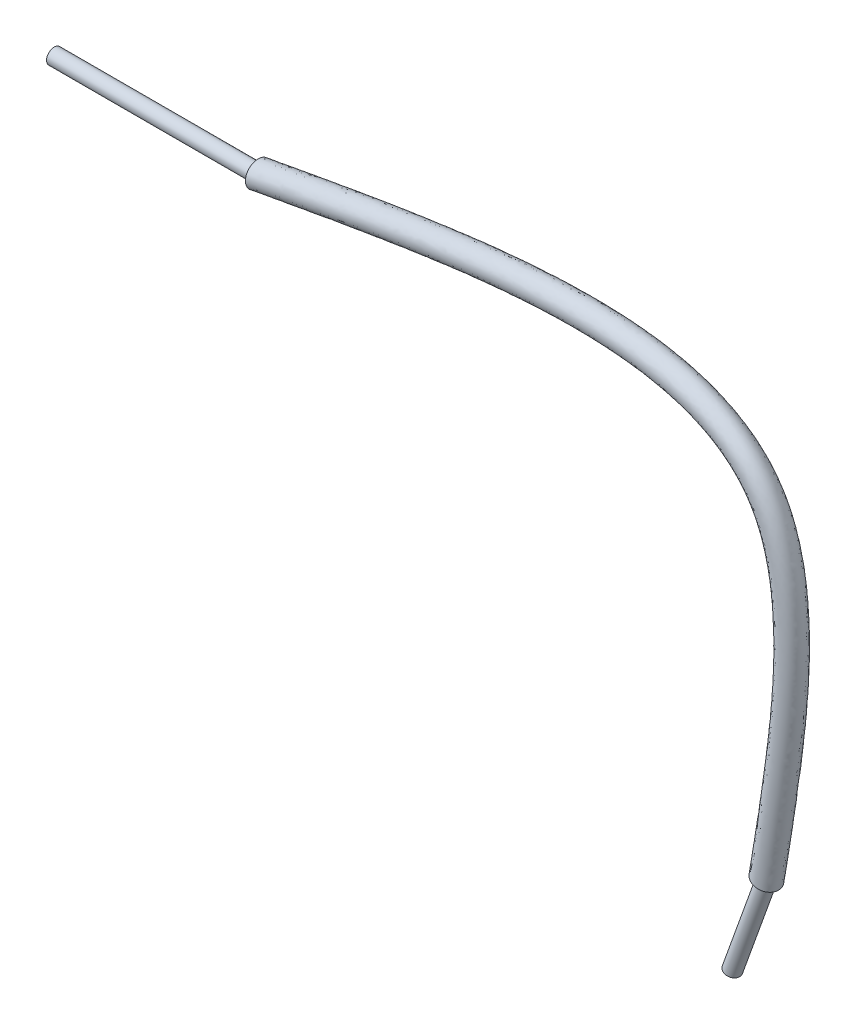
ISO-10303-21;
HEADER;
FILE_DESCRIPTION(('STEP AP214'),'2;1');
FILE_NAME('part.step','',(''),(''),'','','');
FILE_SCHEMA(('AUTOMOTIVE_DESIGN { 1 0 10303 214 1 1 1 1 }'));
ENDSEC;
DATA;
#1=APPLICATION_CONTEXT('core data for automotive mechanical design processes');
#2=APPLICATION_PROTOCOL_DEFINITION('international standard','automotive_design',2000,#1);
#3=PRODUCT_CONTEXT('',#1,'mechanical');
#4=PRODUCT('Part','Part','',(#3));
#5=PRODUCT_RELATED_PRODUCT_CATEGORY('part','',(#4));
#6=PRODUCT_DEFINITION_FORMATION('','',#4);
#7=PRODUCT_DEFINITION_CONTEXT('part definition',#1,'design');
#8=PRODUCT_DEFINITION('design','',#6,#7);
#9=PRODUCT_DEFINITION_SHAPE('','',#8);
#10=(LENGTH_UNIT() NAMED_UNIT(*) SI_UNIT(.MILLI.,.METRE.));
#11=(NAMED_UNIT(*) PLANE_ANGLE_UNIT() SI_UNIT($,.RADIAN.));
#12=(NAMED_UNIT(*) SI_UNIT($,.STERADIAN.) SOLID_ANGLE_UNIT());
#13=UNCERTAINTY_MEASURE_WITH_UNIT(LENGTH_MEASURE(1.E-05),#10,'distance_accuracy_value','');
#14=(GEOMETRIC_REPRESENTATION_CONTEXT(3) GLOBAL_UNCERTAINTY_ASSIGNED_CONTEXT((#13)) GLOBAL_UNIT_ASSIGNED_CONTEXT((#10,
#11,#12)) REPRESENTATION_CONTEXT('',''));
#15=CARTESIAN_POINT('',(0.,0.,0.));
#16=DIRECTION('',(0.,0.,1.));
#17=DIRECTION('',(1.,0.,0.));
#18=AXIS2_PLACEMENT_3D('',#15,#16,#17);
#19=CARTESIAN_POINT('',(0.,0.,1.25000000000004));
#20=DIRECTION('',(-1.,0.,0.));
#21=DIRECTION('',(0.,0.,1.));
#22=AXIS2_PLACEMENT_3D('',#19,#20,#21);
#23=PLANE('',#22);
#24=CARTESIAN_POINT('',(0.,0.,0.));
#25=DIRECTION('',(1.,0.,0.));
#26=DIRECTION('',(0.,0.,-1.));
#27=AXIS2_PLACEMENT_3D('',#24,#25,#26);
#28=CIRCLE('',#27,1.25);
#29=CARTESIAN_POINT('',(0.,-1.11022302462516E-13,-1.24999999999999));
#30=VERTEX_POINT('',#29);
#31=EDGE_CURVE('E41',#30,#30,#28,.T.);
#32=ORIENTED_EDGE('',*,*,#31,.F.);
#33=EDGE_LOOP('',(#32));
#34=FACE_BOUND('',#33,.T.);
#35=CARTESIAN_POINT('',(0.,0.,0.));
#36=DIRECTION('',(-1.,0.,0.));
#37=DIRECTION('',(0.,0.,1.));
#38=AXIS2_PLACEMENT_3D('',#35,#36,#37);
#39=CIRCLE('',#38,0.75);
#40=CARTESIAN_POINT('',(0.,0.,0.750000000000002));
#41=VERTEX_POINT('',#40);
#42=EDGE_CURVE('E53',#41,#41,#39,.T.);
#43=ORIENTED_EDGE('',*,*,#42,.F.);
#44=EDGE_LOOP('',(#43));
#45=FACE_BOUND('',#44,.T.);
#46=ADVANCED_FACE('F30',(#34,#45),#23,.T.);
#47=CARTESIAN_POINT('',(49.8530106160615,-34.9239390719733,1.25000000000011));
#48=DIRECTION('',(0.338341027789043,0.941023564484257,0.));
#49=DIRECTION('',(-0.941023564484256,0.338341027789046,0.));
#50=AXIS2_PLACEMENT_3D('',#47,#48,#49);
#51=PLANE('',#50);
#52=CARTESIAN_POINT('',(49.8530106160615,-34.9239390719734,1.59594559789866E-13));
#53=DIRECTION('',(0.338341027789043,0.941023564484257,0.));
#54=DIRECTION('',(-0.941023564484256,0.338341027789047,0.));
#55=AXIS2_PLACEMENT_3D('',#52,#53,#54);
#56=CIRCLE('',#55,1.25);
#57=CARTESIAN_POINT('',(49.8530106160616,-34.9239390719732,-1.24999999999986));
#58=VERTEX_POINT('',#57);
#59=EDGE_CURVE('E37',#58,#58,#56,.T.);
#60=ORIENTED_EDGE('',*,*,#59,.F.);
#61=EDGE_LOOP('',(#60));
#62=FACE_BOUND('',#61,.T.);
#63=CARTESIAN_POINT('',(49.8932235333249,-34.938397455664,0.));
#64=DIRECTION('',(0.338341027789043,0.941023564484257,0.));
#65=DIRECTION('',(-0.941023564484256,0.338341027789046,0.));
#66=AXIS2_PLACEMENT_3D('',#63,#64,#65);
#67=CIRCLE('',#66,0.750000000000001);
#68=CARTESIAN_POINT('',(49.1874558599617,-34.6846416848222,0.));
#69=VERTEX_POINT('',#68);
#70=EDGE_CURVE('E10',#69,#69,#67,.F.);
#71=ORIENTED_EDGE('',*,*,#70,.F.);
#72=EDGE_LOOP('',(#71));
#73=FACE_BOUND('',#72,.T.);
#74=ADVANCED_FACE('F32',(#62,#73),#51,.F.);
#75=CARTESIAN_POINT('',(0.,-1.11022302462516E-13,-1.24999999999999));
#76=CARTESIAN_POINT('',(4.93038306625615,0.90182242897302,-1.24999999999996));
#77=CARTESIAN_POINT('',(14.3795757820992,2.6301858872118,-1.24999999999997));
#78=CARTESIAN_POINT('',(26.0343814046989,4.12378936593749,-1.24999999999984));
#79=CARTESIAN_POINT('',(34.6387693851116,4.21901751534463,-1.24999999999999));
#80=CARTESIAN_POINT('',(40.2565816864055,3.57628619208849,-1.24999999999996));
#81=CARTESIAN_POINT('',(44.467741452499,2.21970812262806,-1.24999999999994));
#82=CARTESIAN_POINT('',(47.3048815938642,0.449407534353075,-1.24999999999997));
#83=CARTESIAN_POINT('',(49.1372317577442,-1.32205443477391,-1.24999999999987));
#84=CARTESIAN_POINT('',(50.528873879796,-3.50994213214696,-1.2499999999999));
#85=CARTESIAN_POINT('',(51.4767465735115,-6.07059052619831,-1.24999999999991));
#86=CARTESIAN_POINT('',(52.0576376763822,-8.95034832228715,-1.24999999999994));
#87=CARTESIAN_POINT('',(52.5220578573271,-14.598932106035,-1.24999999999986));
#88=CARTESIAN_POINT('',(51.7688243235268,-23.354340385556,-1.24999999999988));
#89=CARTESIAN_POINT('',(50.5149165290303,-30.9266893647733,-1.2499999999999));
#90=CARTESIAN_POINT('',(49.8530106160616,-34.9239390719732,-1.24999999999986));
#91=CARTESIAN_POINT('',(-1.2490009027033E-13,2.50000000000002,-1.24999999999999));
#92=CARTESIAN_POINT('',(4.94283062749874,3.40164924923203,-1.24999999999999));
#93=CARTESIAN_POINT('',(14.4158793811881,5.12968080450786,-1.24999999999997));
#94=CARTESIAN_POINT('',(26.2561287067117,6.6205317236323,-1.25000000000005));
#95=CARTESIAN_POINT('',(35.1856064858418,6.66440684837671,-1.24999999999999));
#96=CARTESIAN_POINT('',(41.1689684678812,5.91937891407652,-1.24999999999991));
#97=CARTESIAN_POINT('',(45.8683143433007,4.3237092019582,-1.25000000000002));
#98=CARTESIAN_POINT('',(49.1763043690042,2.13525909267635,-1.25000000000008));
#99=CARTESIAN_POINT('',(51.3458958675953,-0.100135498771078,-1.25));
#100=CARTESIAN_POINT('',(52.9600741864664,-2.84874520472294,-1.25000000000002));
#101=CARTESIAN_POINT('',(53.9769687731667,-5.85716318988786,-1.24999999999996));
#102=CARTESIAN_POINT('',(54.5602702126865,-9.07205493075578,-1.24999999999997));
#103=CARTESIAN_POINT('',(54.9768066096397,-15.1497330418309,-1.24999999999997));
#104=CARTESIAN_POINT('',(54.1368805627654,-24.1500343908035,-1.24999999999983));
#105=CARTESIAN_POINT('',(52.8728297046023,-31.7552123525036,-1.25000000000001));
#106=CARTESIAN_POINT('',(52.2055695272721,-35.7697916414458,-1.24999999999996));
#107=CARTESIAN_POINT('',(0.,2.50000000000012,1.25000000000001));
#108=CARTESIAN_POINT('',(4.94283062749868,3.40164924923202,1.25000000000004));
#109=CARTESIAN_POINT('',(14.4158793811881,5.12968080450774,1.25));
#110=CARTESIAN_POINT('',(26.2561287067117,6.62053172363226,1.24999999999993));
#111=CARTESIAN_POINT('',(35.1856064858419,6.6644068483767,1.24999999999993));
#112=CARTESIAN_POINT('',(41.1689684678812,5.91937891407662,1.25000000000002));
#113=CARTESIAN_POINT('',(45.8683143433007,4.3237092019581,1.24999999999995));
#114=CARTESIAN_POINT('',(49.1763043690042,2.13525909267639,1.24999999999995));
#115=CARTESIAN_POINT('',(51.3458958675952,-0.100135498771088,1.2500000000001));
#116=CARTESIAN_POINT('',(52.9600741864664,-2.84874520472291,1.24999999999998));
#117=CARTESIAN_POINT('',(53.9769687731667,-5.85716318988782,1.24999999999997));
#118=CARTESIAN_POINT('',(54.5602702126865,-9.07205493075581,1.24999999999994));
#119=CARTESIAN_POINT('',(54.9768066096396,-15.1497330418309,1.25000000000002));
#120=CARTESIAN_POINT('',(54.1368805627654,-24.1500343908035,1.25000000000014));
#121=CARTESIAN_POINT('',(52.8728297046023,-31.7552123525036,1.25000000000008));
#122=CARTESIAN_POINT('',(52.2055695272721,-35.7697916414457,1.25000000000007));
#123=CARTESIAN_POINT('',(0.,0.,1.25000000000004));
#124=CARTESIAN_POINT('',(4.93038306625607,0.901822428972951,1.25000000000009));
#125=CARTESIAN_POINT('',(14.3795757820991,2.63018588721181,1.25000000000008));
#126=CARTESIAN_POINT('',(26.0343814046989,4.12378936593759,1.25000000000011));
#127=CARTESIAN_POINT('',(34.6387693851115,4.21901751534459,1.25000000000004));
#128=CARTESIAN_POINT('',(40.2565816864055,3.57628619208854,1.25000000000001));
#129=CARTESIAN_POINT('',(44.467741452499,2.21970812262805,1.25000000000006));
#130=CARTESIAN_POINT('',(47.3048815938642,0.449407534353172,1.24999999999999));
#131=CARTESIAN_POINT('',(49.1372317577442,-1.32205443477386,1.25000000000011));
#132=CARTESIAN_POINT('',(50.528873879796,-3.50994213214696,1.25000000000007));
#133=CARTESIAN_POINT('',(51.4767465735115,-6.07059052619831,1.25000000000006));
#134=CARTESIAN_POINT('',(52.0576376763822,-8.95034832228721,1.25000000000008));
#135=CARTESIAN_POINT('',(52.5220578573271,-14.5989321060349,1.25000000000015));
#136=CARTESIAN_POINT('',(51.7688243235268,-23.354340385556,1.2500000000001));
#137=CARTESIAN_POINT('',(50.5149165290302,-30.9266893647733,1.25000000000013));
#138=CARTESIAN_POINT('',(49.8530106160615,-34.9239390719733,1.25000000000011));
#139=CARTESIAN_POINT('',(0.,-2.49999999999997,1.25));
#140=CARTESIAN_POINT('',(4.91793550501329,-1.59800439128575,1.25));
#141=CARTESIAN_POINT('',(14.34327218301,0.130690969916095,1.25000000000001));
#142=CARTESIAN_POINT('',(25.812634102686,1.62704700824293,1.25000000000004));
#143=CARTESIAN_POINT('',(34.0919322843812,1.77362818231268,1.24999999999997));
#144=CARTESIAN_POINT('',(39.3441949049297,1.23319347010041,1.2500000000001));
#145=CARTESIAN_POINT('',(43.0671685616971,0.115707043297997,1.25000000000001));
#146=CARTESIAN_POINT('',(45.433458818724,-1.23644402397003,1.24999999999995));
#147=CARTESIAN_POINT('',(46.9285676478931,-2.54397337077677,1.25000000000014));
#148=CARTESIAN_POINT('',(48.0976735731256,-4.171139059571,1.24999999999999));
#149=CARTESIAN_POINT('',(48.9765243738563,-6.28401786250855,1.25000000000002));
#150=CARTESIAN_POINT('',(49.5550051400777,-8.82864171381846,1.24999999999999));
#151=CARTESIAN_POINT('',(50.0673091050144,-14.0481311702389,1.25000000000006));
#152=CARTESIAN_POINT('',(49.4007680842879,-22.5586463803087,1.25000000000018));
#153=CARTESIAN_POINT('',(48.1570033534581,-30.0981663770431,1.25000000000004));
#154=CARTESIAN_POINT('',(47.5004517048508,-34.0780865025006,1.25000000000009));
#155=CARTESIAN_POINT('',(0.,-2.49999999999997,-1.24999999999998));
#156=CARTESIAN_POINT('',(4.91793550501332,-1.59800439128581,-1.25));
#157=CARTESIAN_POINT('',(14.3432721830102,0.130690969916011,-1.25000000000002));
#158=CARTESIAN_POINT('',(25.8126341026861,1.62704700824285,-1.24999999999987));
#159=CARTESIAN_POINT('',(34.0919322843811,1.7736281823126,-1.25));
#160=CARTESIAN_POINT('',(39.3441949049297,1.23319347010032,-1.24999999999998));
#161=CARTESIAN_POINT('',(43.0671685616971,0.115707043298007,-1.25000000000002));
#162=CARTESIAN_POINT('',(45.433458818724,-1.23644402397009,-1.25000000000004));
#163=CARTESIAN_POINT('',(46.9285676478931,-2.54397337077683,-1.24999999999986));
#164=CARTESIAN_POINT('',(48.0976735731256,-4.17113905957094,-1.25000000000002));
#165=CARTESIAN_POINT('',(48.9765243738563,-6.28401786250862,-1.24999999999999));
#166=CARTESIAN_POINT('',(49.5550051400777,-8.8286417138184,-1.25000000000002));
#167=CARTESIAN_POINT('',(50.0673091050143,-14.0481311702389,-1.25000000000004));
#168=CARTESIAN_POINT('',(49.4007680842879,-22.5586463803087,-1.24999999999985));
#169=CARTESIAN_POINT('',(48.1570033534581,-30.0981663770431,-1.24999999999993));
#170=CARTESIAN_POINT('',(47.5004517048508,-34.0780865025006,-1.24999999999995));
#171=CARTESIAN_POINT('',(0.,-1.11022302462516E-13,-1.24999999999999));
#172=CARTESIAN_POINT('',(4.93038306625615,0.90182242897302,-1.24999999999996));
#173=CARTESIAN_POINT('',(14.3795757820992,2.6301858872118,-1.24999999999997));
#174=CARTESIAN_POINT('',(26.0343814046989,4.12378936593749,-1.24999999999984));
#175=CARTESIAN_POINT('',(34.6387693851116,4.21901751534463,-1.24999999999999));
#176=CARTESIAN_POINT('',(40.2565816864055,3.57628619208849,-1.24999999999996));
#177=CARTESIAN_POINT('',(44.467741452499,2.21970812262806,-1.24999999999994));
#178=CARTESIAN_POINT('',(47.3048815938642,0.449407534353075,-1.24999999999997));
#179=CARTESIAN_POINT('',(49.1372317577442,-1.32205443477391,-1.24999999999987));
#180=CARTESIAN_POINT('',(50.528873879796,-3.50994213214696,-1.2499999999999));
#181=CARTESIAN_POINT('',(51.4767465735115,-6.07059052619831,-1.24999999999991));
#182=CARTESIAN_POINT('',(52.0576376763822,-8.95034832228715,-1.24999999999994));
#183=CARTESIAN_POINT('',(52.5220578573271,-14.598932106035,-1.24999999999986));
#184=CARTESIAN_POINT('',(51.7688243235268,-23.354340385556,-1.24999999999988));
#185=CARTESIAN_POINT('',(50.5149165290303,-30.9266893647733,-1.2499999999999));
#186=CARTESIAN_POINT('',(49.8530106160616,-34.9239390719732,-1.24999999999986));
#187=(BOUNDED_SURFACE() B_SPLINE_SURFACE(3,3,((#75,#76,#77,#78,#79,#80,#81,#82,#83,#84,#85,#86,
#87,#88,#89,#90),(#91,#92,#93,#94,#95,#96,#97,#98,#99,#100,#101,#102,#103,#104,#105,#106),(#107,
#108,#109,#110,#111,#112,#113,#114,#115,#116,#117,#118,#119,#120,#121,#122),(#123,#124,#125,
#126,#127,#128,#129,#130,#131,#132,#133,#134,#135,#136,#137,#138),(#139,#140,#141,#142,#143,
#144,#145,#146,#147,#148,#149,#150,#151,#152,#153,#154),(#155,#156,#157,#158,#159,#160,#161,
#162,#163,#164,#165,#166,#167,#168,#169,#170),(#171,#172,#173,#174,#175,#176,#177,#178,#179,
#180,#181,#182,#183,#184,#185,#186)),.UNSPECIFIED.,.T.,.F.,.F.) B_SPLINE_SURFACE_WITH_KNOTS((4,
3,4),(4,1,1,1,1,1,1,1,1,1,1,1,1,4),(0.,0.5,1.),(0.,0.176626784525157,0.338509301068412,
0.413158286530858,0.479280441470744,0.537091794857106,0.567197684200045,0.59642904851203,
0.62616625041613,0.657797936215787,0.692115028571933,0.729389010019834,0.857151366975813,1.),
.UNSPECIFIED.) GEOMETRIC_REPRESENTATION_ITEM() RATIONAL_B_SPLINE_SURFACE(((1.,1.,1.,1.,1.,1.,1.,
1.,1.,1.,1.,1.,1.,1.,1.,1.),(0.333333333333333,0.333333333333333,0.333333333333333,
0.333333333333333,0.333333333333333,0.333333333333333,0.333333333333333,0.333333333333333,
0.333333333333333,0.333333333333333,0.333333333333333,0.333333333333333,0.333333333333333,
0.333333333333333,0.333333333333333,0.333333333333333),(0.333333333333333,0.333333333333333,
0.333333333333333,0.333333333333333,0.333333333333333,0.333333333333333,0.333333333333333,
0.333333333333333,0.333333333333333,0.333333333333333,0.333333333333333,0.333333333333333,
0.333333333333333,0.333333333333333,0.333333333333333,0.333333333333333),(1.,1.,1.,1.,1.,1.,1.,
1.,1.,1.,1.,1.,1.,1.,1.,1.),(0.333333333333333,0.333333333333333,0.333333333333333,
0.333333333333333,0.333333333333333,0.333333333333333,0.333333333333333,0.333333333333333,
0.333333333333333,0.333333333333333,0.333333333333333,0.333333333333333,0.333333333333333,
0.333333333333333,0.333333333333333,0.333333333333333),(0.333333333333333,0.333333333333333,
0.333333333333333,0.333333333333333,0.333333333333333,0.333333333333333,0.333333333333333,
0.333333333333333,0.333333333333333,0.333333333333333,0.333333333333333,0.333333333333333,
0.333333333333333,0.333333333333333,0.333333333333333,0.333333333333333),(1.,1.,1.,1.,1.,1.,1.,
1.,1.,1.,1.,1.,1.,1.,1.,1.))) REPRESENTATION_ITEM('') SURFACE());
#188=CARTESIAN_POINT('',(0.,-1.11022302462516E-13,-1.24999999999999));
#189=CARTESIAN_POINT('',(0.0545197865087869,0.00997228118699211,-1.24999999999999));
#190=CARTESIAN_POINT('',(0.109039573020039,0.0199445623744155,-1.24999999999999));
#191=CARTESIAN_POINT('',(0.218079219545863,0.0398887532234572,-1.24999999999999));
#192=CARTESIAN_POINT('',(0.272599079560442,0.0498606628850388,-1.24999999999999));
#193=CARTESIAN_POINT('',(0.381638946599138,0.0698037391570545,-1.24999999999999));
#194=CARTESIAN_POINT('',(0.436158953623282,0.0797749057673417,-1.24999999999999));
#195=CARTESIAN_POINT('',(0.545199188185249,0.0997161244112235,-1.24999999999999));
#196=CARTESIAN_POINT('',(0.599719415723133,0.109686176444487,-1.24999999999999));
#197=CARTESIAN_POINT('',(0.708760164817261,0.129624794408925,-1.24999999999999));
#198=CARTESIAN_POINT('',(0.763280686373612,0.13959336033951,-1.24999999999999));
#199=CARTESIAN_POINT('',(0.872322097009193,0.159528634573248,-1.24999999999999));
#200=CARTESIAN_POINT('',(0.926842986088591,0.169495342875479,-1.24999999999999));
#201=CARTESIAN_POINT('',(1.03588520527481,0.189426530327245,-1.24999999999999));
#202=CARTESIAN_POINT('',(1.09040653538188,0.19939100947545,-1.24999999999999));
#203=CARTESIAN_POINT('',(1.19944971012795,0.219317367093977,-1.24999999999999));
#204=CARTESIAN_POINT('',(1.25397155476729,0.229279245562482,-1.24999999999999));
#205=CARTESIAN_POINT('',(1.36301583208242,0.2492000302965,-1.24999999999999));
#206=CARTESIAN_POINT('',(1.41753826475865,0.25915893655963,-1.24999999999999));
#207=CARTESIAN_POINT('',(1.52658379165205,0.279073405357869,-1.24999999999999));
#208=CARTESIAN_POINT('',(1.58110688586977,0.28902896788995,-1.24999999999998));
#209=CARTESIAN_POINT('',(1.69015380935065,0.308936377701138,-1.24999999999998));
#210=CARTESIAN_POINT('',(1.74467763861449,0.318888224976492,-1.24999999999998));
#211=CARTESIAN_POINT('',(1.85372610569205,0.338787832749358,-1.24999999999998));
#212=CARTESIAN_POINT('',(1.90825074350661,0.348735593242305,-1.24999999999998));
#213=CARTESIAN_POINT('',(2.01730090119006,0.368626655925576,-1.24999999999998));
#214=CARTESIAN_POINT('',(2.07182642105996,0.378569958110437,-1.24999999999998));
#215=CARTESIAN_POINT('',(2.18087841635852,0.398451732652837,-1.24999999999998));
#216=CARTESIAN_POINT('',(2.23540489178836,0.40839020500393,-1.24999999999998));
#217=CARTESIAN_POINT('',(2.34445887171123,0.428261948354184,-1.24999999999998));
#218=CARTESIAN_POINT('',(2.39898637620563,0.438195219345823,-1.24999999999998));
#219=CARTESIAN_POINT('',(2.50804248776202,0.458056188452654,-1.24999999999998));
#220=CARTESIAN_POINT('',(2.5625710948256,0.467983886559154,-1.24999999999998));
#221=CARTESIAN_POINT('',(2.67162948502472,0.487833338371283,-1.24999999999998));
#222=CARTESIAN_POINT('',(2.72615926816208,0.497755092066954,-1.24999999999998));
#223=CARTESIAN_POINT('',(2.83522008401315,0.517592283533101,-1.24999999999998));
#224=CARTESIAN_POINT('',(2.88975111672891,0.527507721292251,-1.24999999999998));
#225=CARTESIAN_POINT('',(2.99881450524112,0.547331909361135,-1.24999999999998));
#226=CARTESIAN_POINT('',(3.0533468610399,0.55724065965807,-1.24999999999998));
#227=CARTESIAN_POINT('',(3.16241296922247,0.577051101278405,-1.24999999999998));
#228=CARTESIAN_POINT('',(3.21694672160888,0.586952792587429,-1.24999999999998));
#229=CARTESIAN_POINT('',(3.32601569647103,0.606748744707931,-1.24999999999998));
#230=CARTESIAN_POINT('',(3.38055091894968,0.616643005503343,-1.24999999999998));
#231=CARTESIAN_POINT('',(3.48962290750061,0.636423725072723,-1.24999999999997));
#232=CARTESIAN_POINT('',(3.54415967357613,0.646310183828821,-1.24999999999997));
#233=CARTESIAN_POINT('',(3.65323482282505,0.666074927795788,-1.24999999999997));
#234=CARTESIAN_POINT('',(3.70777320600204,0.675953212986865,-1.24999999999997));
#235=CARTESIAN_POINT('',(3.81685166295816,0.695701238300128,-1.24999999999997));
#236=CARTESIAN_POINT('',(3.87139173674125,0.705570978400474,-1.24999999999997));
#237=CARTESIAN_POINT('',(3.98047364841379,0.725301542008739,-1.24999999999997));
#238=CARTESIAN_POINT('',(4.03501548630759,0.73516236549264,-1.24999999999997));
#239=CARTESIAN_POINT('',(4.14410099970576,0.754874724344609,-1.24999999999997));
#240=CARTESIAN_POINT('',(4.19864467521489,0.764726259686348,-1.24999999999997));
#241=CARTESIAN_POINT('',(4.3077339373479,0.784419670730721,-1.24999999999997));
#242=CARTESIAN_POINT('',(4.36227952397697,0.794261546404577,-1.24999999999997));
#243=CARTESIAN_POINT('',(4.47137268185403,0.813935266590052,-1.24999999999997));
#244=CARTESIAN_POINT('',(4.52592025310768,0.8237671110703,-1.24999999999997));
#245=CARTESIAN_POINT('',(4.635017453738,0.843420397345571,-1.24999999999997));
#246=CARTESIAN_POINT('',(4.68956708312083,0.853241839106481,-1.24999999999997));
#247=CARTESIAN_POINT('',(4.79866847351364,0.87287394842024,-1.24999999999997));
#248=CARTESIAN_POINT('',(4.85322023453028,0.882684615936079,-1.24999999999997));
#249=CARTESIAN_POINT('',(4.96232596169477,0.902294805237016,-1.24999999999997));
#250=CARTESIAN_POINT('',(5.01687992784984,0.912094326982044,-1.24999999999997));
#251=CARTESIAN_POINT('',(5.12599013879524,0.931681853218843,-1.24999999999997));
#252=CARTESIAN_POINT('',(5.18054638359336,0.941469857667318,-1.24999999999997));
#253=CARTESIAN_POINT('',(5.28966122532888,0.961033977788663,-1.24999999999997));
#254=CARTESIAN_POINT('',(5.34421982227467,0.970810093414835,-1.24999999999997));
#255=CARTESIAN_POINT('',(5.45333944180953,0.990350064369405,-1.24999999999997));
#256=CARTESIAN_POINT('',(5.50790046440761,1.00011391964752,-1.24999999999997));
#257=CARTESIAN_POINT('',(5.61702500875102,1.01962899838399,-1.24999999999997));
#258=CARTESIAN_POINT('',(5.67158853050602,1.0293802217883,-1.24999999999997));
#259=CARTESIAN_POINT('',(5.7807181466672,1.04886966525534,-1.24999999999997));
#260=CARTESIAN_POINT('',(5.83528424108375,1.05860788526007,-1.24999999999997));
#261=CARTESIAN_POINT('',(5.94441907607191,1.07807095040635,-1.24999999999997));
#262=CARTESIAN_POINT('',(5.99898781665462,1.08779579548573,-1.24999999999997));
#263=CARTESIAN_POINT('',(6.10812801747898,1.10723173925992,-1.24999999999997));
#264=CARTESIAN_POINT('',(6.16269947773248,1.11694283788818,-1.24999999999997));
#265=CARTESIAN_POINT('',(6.27184519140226,1.13635091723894,-1.24999999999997));
#266=CARTESIAN_POINT('',(6.32641944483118,1.1460478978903,-1.24999999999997));
#267=CARTESIAN_POINT('',(6.43557081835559,1.16542736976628,-1.24999999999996));
#268=CARTESIAN_POINT('',(6.49014793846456,1.17510986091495,-1.24999999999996));
#269=CARTESIAN_POINT('',(6.59930511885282,1.19445998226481,-1.24999999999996));
#270=CARTESIAN_POINT('',(6.65388517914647,1.204127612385,-1.24999999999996));
#271=CARTESIAN_POINT('',(6.7630483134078,1.22344764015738,-1.24999999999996));
#272=CARTESIAN_POINT('',(6.81763138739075,1.23310003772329,-1.24999999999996));
#273=CARTESIAN_POINT('',(6.92680062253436,1.25238922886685,-1.24999999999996));
#274=CARTESIAN_POINT('',(6.98138678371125,1.26202602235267,-1.24999999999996));
#275=CARTESIAN_POINT('',(7.09056226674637,1.28128363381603,-1.24999999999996));
#276=CARTESIAN_POINT('',(7.14515158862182,1.29090445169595,-1.24999999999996));
#277=CARTESIAN_POINT('',(7.25433346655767,1.31012974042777,-1.24999999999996));
#278=CARTESIAN_POINT('',(7.30892602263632,1.31973421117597,-1.24999999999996));
#279=CARTESIAN_POINT('',(7.41811444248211,1.33892643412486,-1.24999999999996));
#280=CARTESIAN_POINT('',(7.47271030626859,1.34851418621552,-1.24999999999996));
#281=CARTESIAN_POINT('',(7.58190541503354,1.36767260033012,-1.24999999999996));
#282=CARTESIAN_POINT('',(7.63650466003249,1.3772432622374,-1.24999999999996));
#283=CARTESIAN_POINT('',(7.74570660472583,1.39636712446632,-1.24999999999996));
#284=CARTESIAN_POINT('',(7.80030930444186,1.40592032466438,-1.24999999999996));
#285=CARTESIAN_POINT('',(7.90951823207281,1.42500889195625,-1.24999999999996));
#286=CARTESIAN_POINT('',(7.96412446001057,1.43454425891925,-1.24999999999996));
#287=CARTESIAN_POINT('',(8.07334051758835,1.45359678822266,-1.24999999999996));
#288=CARTESIAN_POINT('',(8.12795034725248,1.46311395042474,-1.24999999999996));
#289=CARTESIAN_POINT('',(8.2371736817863,1.48212969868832,-1.24999999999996));
#290=CARTESIAN_POINT('',(8.29178718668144,1.49162828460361,-1.24999999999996));
#291=CARTESIAN_POINT('',(8.40101794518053,1.51060650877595,-1.24999999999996));
#292=CARTESIAN_POINT('',(8.45563519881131,1.52008614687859,-1.24999999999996));
#293=CARTESIAN_POINT('',(8.56487352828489,1.53902610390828,-1.24999999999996));
#294=CARTESIAN_POINT('',(8.61949460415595,1.54848642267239,-1.24999999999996));
#295=CARTESIAN_POINT('',(8.72874065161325,1.56738736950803,-1.24999999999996));
#296=CARTESIAN_POINT('',(8.78336562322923,1.57682799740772,-1.24999999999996));
#297=CARTESIAN_POINT('',(8.89261953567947,1.59568919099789,-1.24999999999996));
#298=CARTESIAN_POINT('',(8.947248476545,1.60510975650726,-1.24999999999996));
#299=CARTESIAN_POINT('',(9.05651040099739,1.62393045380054,-1.24999999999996));
#300=CARTESIAN_POINT('',(9.11114338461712,1.63333058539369,-1.24999999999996));
#301=CARTESIAN_POINT('',(9.22041346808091,1.65211004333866,-1.24999999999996));
#302=CARTESIAN_POINT('',(9.27505056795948,1.66148936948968,-1.24999999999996));
#303=CARTESIAN_POINT('',(9.38432895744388,1.6802268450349,-1.24999999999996));
#304=CARTESIAN_POINT('',(9.43897024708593,1.68958499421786,-1.24999999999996));
#305=CARTESIAN_POINT('',(9.54825708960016,1.70827974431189,-1.24999999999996));
#306=CARTESIAN_POINT('',(9.60290264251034,1.71761634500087,-1.24999999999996));
#307=CARTESIAN_POINT('',(9.71219808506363,1.73626762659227,-1.24999999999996));
#308=CARTESIAN_POINT('',(9.76684797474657,1.74558230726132,-1.24999999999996));
#309=CARTESIAN_POINT('',(9.87615216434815,1.76418937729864,-1.24999999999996));
#310=CARTESIAN_POINT('',(9.9308064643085,1.77348176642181,-1.24999999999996));
#311=CARTESIAN_POINT('',(10.0401195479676,1.79204388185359,-1.24999999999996));
#312=CARTESIAN_POINT('',(10.09477833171,1.80131360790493,-1.24999999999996));
#313=CARTESIAN_POINT('',(10.2041004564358,1.81983002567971,-1.24999999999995));
#314=CARTESIAN_POINT('',(10.2587637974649,1.82907671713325,-1.24999999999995));
#315=CARTESIAN_POINT('',(10.3680951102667,1.84754669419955,-1.24999999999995));
#316=CARTESIAN_POINT('',(10.4227630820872,1.85676997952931,-1.24999999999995));
#317=CARTESIAN_POINT('',(10.5321037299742,1.87519277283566,-1.24999999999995));
#318=CARTESIAN_POINT('',(10.5867764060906,1.88439228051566,-1.24999999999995));
#319=CARTESIAN_POINT('',(10.696126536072,1.90276714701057,-1.24999999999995));
#320=CARTESIAN_POINT('',(10.7508039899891,1.9119425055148,-1.24999999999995));
#321=CARTESIAN_POINT('',(10.8601637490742,1.93026870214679,-1.24999999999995));
#322=CARTESIAN_POINT('',(10.9148460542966,1.93941953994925,-1.24999999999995));
#323=CARTESIAN_POINT('',(11.0242155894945,1.95769632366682,-1.24999999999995));
#324=CARTESIAN_POINT('',(11.0789028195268,1.96682226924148,-1.24999999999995));
#325=CARTESIAN_POINT('',(11.1882822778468,1.98504889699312,-1.24999999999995));
#326=CARTESIAN_POINT('',(11.2429745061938,1.99414957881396,-1.24999999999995));
#327=CARTESIAN_POINT('',(11.3523640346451,2.01232530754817,-1.24999999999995));
#328=CARTESIAN_POINT('',(11.4070613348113,2.02140035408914,-1.24999999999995));
#329=CARTESIAN_POINT('',(11.5164610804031,2.03952444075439,-1.24999999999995));
#330=CARTESIAN_POINT('',(11.5711635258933,2.04857348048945,-1.24999999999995));
#331=CARTESIAN_POINT('',(11.6805736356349,2.06664518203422,-1.24999999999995));
#332=CARTESIAN_POINT('',(11.7352812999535,2.07566784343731,-1.24999999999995));
#333=CARTESIAN_POINT('',(11.8447019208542,2.09368641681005,-1.24999999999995));
#334=CARTESIAN_POINT('',(11.899414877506,2.10268232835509,-1.24999999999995));
#335=CARTESIAN_POINT('',(12.0088461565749,2.12064703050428,-1.24999999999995));
#336=CARTESIAN_POINT('',(12.0635644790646,2.12961582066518,-1.24999999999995));
#337=CARTESIAN_POINT('',(12.1730065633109,2.14752590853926,-1.24999999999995));
#338=CARTESIAN_POINT('',(12.2277303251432,2.15646720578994,-1.24999999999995));
#339=CARTESIAN_POINT('',(12.3371833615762,2.17432193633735,-1.24999999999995));
#340=CARTESIAN_POINT('',(12.3919126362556,2.18323536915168,-1.24999999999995));
#341=CARTESIAN_POINT('',(12.5013767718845,2.20103399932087,-1.24999999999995));
#342=CARTESIAN_POINT('',(12.5561116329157,2.20991919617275,-1.24999999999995));
#343=CARTESIAN_POINT('',(12.6655870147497,2.22766098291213,-1.24999999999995));
#344=CARTESIAN_POINT('',(12.7203275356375,2.23651757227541,-1.24999999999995));
#345=CARTESIAN_POINT('',(12.8298143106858,2.25420177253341,-1.24999999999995));
#346=CARTESIAN_POINT('',(12.8845605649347,2.26302938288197,-1.24999999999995));
#347=CARTESIAN_POINT('',(12.9940588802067,2.28065525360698,-1.24999999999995));
#348=CARTESIAN_POINT('',(13.0488109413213,2.28945351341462,-1.24999999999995));
#349=CARTESIAN_POINT('',(13.1583209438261,2.30702031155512,-1.24999999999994));
#350=CARTESIAN_POINT('',(13.2130788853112,2.31578884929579,-1.24999999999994));
#351=CARTESIAN_POINT('',(13.322600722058,2.33329583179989,-1.24999999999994));
#352=CARTESIAN_POINT('',(13.3773646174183,2.34203427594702,-1.24999999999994));
#353=CARTESIAN_POINT('',(13.4868984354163,2.35948069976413,-1.24999999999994));
#354=CARTESIAN_POINT('',(13.5416683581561,2.36818867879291,-1.24999999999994));
#355=CARTESIAN_POINT('',(13.651214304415,2.38557380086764,-1.24999999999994));
#356=CARTESIAN_POINT('',(13.7059903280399,2.39425094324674,-1.24999999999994));
#357=CARTESIAN_POINT('',(13.8155485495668,2.41157402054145,-1.24999999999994));
#358=CARTESIAN_POINT('',(13.8703307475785,2.42021995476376,-1.24999999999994));
#359=CARTESIAN_POINT('',(13.9799013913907,2.43748024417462,-1.24999999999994));
#360=CARTESIAN_POINT('',(14.0346898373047,2.4460945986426,-1.24999999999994));
#361=CARTESIAN_POINT('',(14.1442730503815,2.46329135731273,-1.24999999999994));
#362=CARTESIAN_POINT('',(14.1990678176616,2.47187376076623,-1.24999999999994));
#363=CARTESIAN_POINT('',(14.3086637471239,2.48900624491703,-1.24999999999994));
#364=CARTESIAN_POINT('',(14.3634649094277,2.49755632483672,-1.24999999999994));
#365=CARTESIAN_POINT('',(14.4730737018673,2.51462379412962,-1.24999999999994));
#366=CARTESIAN_POINT('',(14.5278813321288,2.52314118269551,-1.24999999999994));
#367=CARTESIAN_POINT('',(14.6375031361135,2.54014288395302,-1.24999999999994));
#368=CARTESIAN_POINT('',(14.6923173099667,2.54862719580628,-1.24999999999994));
#369=CARTESIAN_POINT('',(14.8019522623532,2.56556242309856,-1.24999999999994));
#370=CARTESIAN_POINT('',(14.8567730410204,2.57401333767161,-1.24999999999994));
#371=CARTESIAN_POINT('',(14.9664212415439,2.59088110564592,-1.24999999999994));
#372=CARTESIAN_POINT('',(15.021248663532,2.59929795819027,-1.24999999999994));
#373=CARTESIAN_POINT('',(15.1309101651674,2.61609667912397,-1.24999999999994));
#374=CARTESIAN_POINT('',(15.1857442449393,2.62447854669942,-1.24999999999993));
#375=CARTESIAN_POINT('',(15.2954190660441,2.641206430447,-1.24999999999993));
#376=CARTESIAN_POINT('',(15.350259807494,2.64955244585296,-1.24999999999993));
#377=CARTESIAN_POINT('',(15.4599479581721,2.66620774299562,-1.24999999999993));
#378=CARTESIAN_POINT('',(15.5147953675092,2.67451702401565,-1.24999999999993));
#379=CARTESIAN_POINT('',(15.6244968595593,2.69109797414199,-1.24999999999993));
#380=CARTESIAN_POINT('',(15.6793509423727,2.69936964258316,-1.24999999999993));
#381=CARTESIAN_POINT('',(15.7890657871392,2.71587448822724,-1.24999999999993));
#382=CARTESIAN_POINT('',(15.8439265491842,2.7241076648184,-1.24999999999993));
#383=CARTESIAN_POINT('',(15.9536547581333,2.74053464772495,-1.24999999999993));
#384=CARTESIAN_POINT('',(16.0085222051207,2.74872845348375,-1.24999999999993));
#385=CARTESIAN_POINT('',(16.1182637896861,2.76507581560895,-1.24999999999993));
#386=CARTESIAN_POINT('',(16.1731379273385,2.77322937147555,-1.24999999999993));
#387=CARTESIAN_POINT('',(16.2828928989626,2.78949535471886,-1.24999999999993));
#388=CARTESIAN_POINT('',(16.3377737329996,2.79760778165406,-1.24999999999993));
#389=CARTESIAN_POINT('',(16.4475421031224,2.81379062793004,-1.24999999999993));
#390=CARTESIAN_POINT('',(16.5024296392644,2.82186104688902,-1.24999999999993));
#391=CARTESIAN_POINT('',(16.6122114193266,2.8379589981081,-1.24999999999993));
#392=CARTESIAN_POINT('',(16.6671056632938,2.84598653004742,-1.24999999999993));
#393=CARTESIAN_POINT('',(16.7769008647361,2.86199782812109,-1.24999999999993));
#394=CARTESIAN_POINT('',(16.8318018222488,2.86998159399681,-1.24999999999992));
#395=CARTESIAN_POINT('',(16.9416104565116,2.88590448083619,-1.24999999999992));
#396=CARTESIAN_POINT('',(16.9965181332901,2.89384360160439,-1.24999999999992));
#397=CARTESIAN_POINT('',(17.1063402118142,2.9096763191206,-1.24999999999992));
#398=CARTESIAN_POINT('',(17.1612546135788,2.91756991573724,-1.24999999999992));
#399=CARTESIAN_POINT('',(17.2710901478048,2.93331070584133,-1.24999999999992));
#400=CARTESIAN_POINT('',(17.3260112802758,2.94115789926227,-1.24999999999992));
#401=CARTESIAN_POINT('',(17.4358602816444,2.95680500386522,-1.24999999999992));
#402=CARTESIAN_POINT('',(17.4907881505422,2.96460491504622,-1.24999999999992));
#403=CARTESIAN_POINT('',(17.6006506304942,2.98015657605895,-1.24999999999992));
#404=CARTESIAN_POINT('',(17.6555852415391,2.98790832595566,-1.24999999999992));
#405=CARTESIAN_POINT('',(17.765461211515,3.00336278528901,-1.24999999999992));
#406=CARTESIAN_POINT('',(17.8204025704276,3.01106549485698,-1.24999999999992));
#407=CARTESIAN_POINT('',(17.9302920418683,3.02642099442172,-1.24999999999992));
#408=CARTESIAN_POINT('',(17.9852401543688,3.03407378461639,-1.24999999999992));
#409=CARTESIAN_POINT('',(18.095143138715,3.04932856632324,-1.24999999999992));
#410=CARTESIAN_POINT('',(18.1500980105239,3.05693055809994,-1.24999999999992));
#411=CARTESIAN_POINT('',(18.2600145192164,3.07208286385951,-1.24999999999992));
#412=CARTESIAN_POINT('',(18.3149761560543,3.07963317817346,-1.24999999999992));
#413=CARTESIAN_POINT('',(18.4249062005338,3.09468124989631,-1.24999999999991));
#414=CARTESIAN_POINT('',(18.4798746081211,3.10217900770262,-1.24999999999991));
#415=CARTESIAN_POINT('',(18.5898181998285,3.11712108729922,-1.24999999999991));
#416=CARTESIAN_POINT('',(18.6447933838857,3.12456540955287,-1.24999999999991));
#417=CARTESIAN_POINT('',(18.7547505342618,3.13939973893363,-1.24999999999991));
#418=CARTESIAN_POINT('',(18.8097325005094,3.14678974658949,-1.24999999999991));
#419=CARTESIAN_POINT('',(18.9197032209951,3.16151456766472,-1.24999999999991));
#420=CARTESIAN_POINT('',(18.9746919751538,3.16884938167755,-1.24999999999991));
#421=CARTESIAN_POINT('',(19.0846762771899,3.18346293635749,-1.24999999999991));
#422=CARTESIAN_POINT('',(19.1396718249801,3.19074167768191,-1.24999999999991));
#423=CARTESIAN_POINT('',(19.2496697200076,3.20524220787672,-1.24999999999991));
#424=CARTESIAN_POINT('',(19.30467206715,3.21246399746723,-1.24999999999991));
#425=CARTESIAN_POINT('',(19.4146835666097,3.22684974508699,-1.24999999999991));
#426=CARTESIAN_POINT('',(19.4696927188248,3.23401370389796,-1.24999999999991));
#427=CARTESIAN_POINT('',(19.5797178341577,3.24828291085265,-1.24999999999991));
#428=CARTESIAN_POINT('',(19.6347337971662,3.25538815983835,-1.24999999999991));
#429=CARTESIAN_POINT('',(19.7447725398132,3.26953906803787,-1.24999999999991));
#430=CARTESIAN_POINT('',(19.7997953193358,3.27658472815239,-1.24999999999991));
#431=CARTESIAN_POINT('',(19.9098477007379,3.29061557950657,-1.24999999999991));
#432=CARTESIAN_POINT('',(19.9648773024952,3.2976007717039,-1.24999999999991));
#433=CARTESIAN_POINT('',(20.0749433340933,3.31150980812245,-1.2499999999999));
#434=CARTESIAN_POINT('',(20.1299797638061,3.31843365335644,-1.2499999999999));
#435=CARTESIAN_POINT('',(20.2400594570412,3.332219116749,-1.2499999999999));
#436=CARTESIAN_POINT('',(20.2951027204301,3.33908073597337,-1.2499999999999));
#437=CARTESIAN_POINT('',(20.4051960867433,3.35274086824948,-1.2499999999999));
#438=CARTESIAN_POINT('',(20.460246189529,3.35953938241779,-1.2499999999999));
#439=CARTESIAN_POINT('',(20.5703532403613,3.3730724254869,-1.2499999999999));
#440=CARTESIAN_POINT('',(20.6254101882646,3.37980695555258,-1.2499999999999));
#441=CARTESIAN_POINT('',(20.735530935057,3.39321115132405,-1.2499999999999));
#442=CARTESIAN_POINT('',(20.7905947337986,3.39988081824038,-1.2499999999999));
#443=CARTESIAN_POINT('',(20.9007291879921,3.41315440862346,-1.2499999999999));
#444=CARTESIAN_POINT('',(20.9557998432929,3.41975833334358,-1.2499999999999));
#445=CARTESIAN_POINT('',(21.0659480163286,3.43289956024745,-1.2499999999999));
#446=CARTESIAN_POINT('',(21.1210255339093,3.43943686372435,-1.2499999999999));
#447=CARTESIAN_POINT('',(21.2311874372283,3.45244396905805,-1.2499999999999));
#448=CARTESIAN_POINT('',(21.2862718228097,3.45891377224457,-1.2499999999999));
#449=CARTESIAN_POINT('',(21.3964474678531,3.47178499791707,-1.2499999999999));
#450=CARTESIAN_POINT('',(21.451538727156,3.4781864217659,-1.2499999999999));
#451=CARTESIAN_POINT('',(21.5617281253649,3.49092000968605,-1.2499999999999));
#452=CARTESIAN_POINT('',(21.6168262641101,3.49725217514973,-1.2499999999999));
#453=CARTESIAN_POINT('',(21.7270294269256,3.50984636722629,-1.2499999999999));
#454=CARTESIAN_POINT('',(21.782134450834,3.51610839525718,-1.2499999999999));
#455=CARTESIAN_POINT('',(21.8923513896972,3.5285614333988,-1.2499999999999));
#456=CARTESIAN_POINT('',(21.9474633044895,3.53475244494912,-1.2499999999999));
#457=CARTESIAN_POINT('',(22.0576940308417,3.54706257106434,-1.24999999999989));
#458=CARTESIAN_POINT('',(22.1128128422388,3.55318168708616,-1.24999999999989));
#459=CARTESIAN_POINT('',(22.2230573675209,3.56534714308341,-1.24999999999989));
#460=CARTESIAN_POINT('',(22.2781830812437,3.57139348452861,-1.24999999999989));
#461=CARTESIAN_POINT('',(22.388441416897,3.58341251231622,-1.24999999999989));
#462=CARTESIAN_POINT('',(22.4435740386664,3.58938520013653,-1.24999999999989));
#463=CARTESIAN_POINT('',(22.553846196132,3.60125604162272,-1.24999999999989));
#464=CARTESIAN_POINT('',(22.6089857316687,3.60715419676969,-1.24999999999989));
#465=CARTESIAN_POINT('',(22.7192717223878,3.61887509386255,-1.24999999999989));
#466=CARTESIAN_POINT('',(22.7744181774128,3.62469783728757,-1.24999999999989));
#467=CARTESIAN_POINT('',(22.8847180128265,3.6362670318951,-1.24999999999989));
#468=CARTESIAN_POINT('',(22.9398713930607,3.6420134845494,-1.24999999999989));
#469=CARTESIAN_POINT('',(23.0501850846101,3.65342921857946,-1.24999999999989));
#470=CARTESIAN_POINT('',(23.1053453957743,3.65909850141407,-1.24999999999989));
#471=CARTESIAN_POINT('',(23.2156729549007,3.67035901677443,-1.24999999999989));
#472=CARTESIAN_POINT('',(23.2708402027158,3.67595025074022,-1.24999999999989));
#473=CARTESIAN_POINT('',(23.3811816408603,3.68705378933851,-1.24999999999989));
#474=CARTESIAN_POINT('',(23.4363558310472,3.69256609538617,-1.24999999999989));
#475=CARTESIAN_POINT('',(23.5467111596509,3.7035108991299,-1.24999999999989));
#476=CARTESIAN_POINT('',(23.6018922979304,3.70894339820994,-1.24999999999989));
#477=CARTESIAN_POINT('',(23.7122615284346,3.71972770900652,-1.24999999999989));
#478=CARTESIAN_POINT('',(23.7674496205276,3.72507952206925,-1.24999999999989));
#479=CARTESIAN_POINT('',(23.8778327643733,3.73570158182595,-1.24999999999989));
#480=CARTESIAN_POINT('',(23.9330278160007,3.74097182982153,-1.24999999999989));
#481=CARTESIAN_POINT('',(24.0434248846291,3.7514298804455,-1.24999999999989));
#482=CARTESIAN_POINT('',(24.0986269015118,3.75661768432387,-1.24999999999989));
#483=CARTESIAN_POINT('',(24.209037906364,3.76690996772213,-1.24999999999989));
#484=CARTESIAN_POINT('',(24.2642468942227,3.77201444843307,-1.24999999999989));
#485=CARTESIAN_POINT('',(24.37467184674,3.78213920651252,-1.24999999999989));
#486=CARTESIAN_POINT('',(24.4298878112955,3.78715948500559,-1.24999999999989));
#487=CARTESIAN_POINT('',(24.5403267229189,3.79711495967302,-1.24999999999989));
#488=CARTESIAN_POINT('',(24.5955496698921,3.8020501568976,-1.24999999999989));
#489=CARTESIAN_POINT('',(24.7060025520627,3.81183459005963,-1.24999999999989));
#490=CARTESIAN_POINT('',(24.7612324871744,3.81668382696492,-1.24999999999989));
#491=CARTESIAN_POINT('',(24.8716993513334,3.82629546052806,-1.24999999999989));
#492=CARTESIAN_POINT('',(24.9269362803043,3.83105785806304,-1.24999999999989));
#493=CARTESIAN_POINT('',(25.0374171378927,3.84049493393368,-1.24999999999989));
#494=CARTESIAN_POINT('',(25.0926610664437,3.84516961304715,-1.24999999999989));
#495=CARTESIAN_POINT('',(25.2031559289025,3.85443037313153,-1.24999999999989));
#496=CARTESIAN_POINT('',(25.2584068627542,3.85901645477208,-1.24999999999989));
#497=CARTESIAN_POINT('',(25.3689157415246,3.8680991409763,-1.24999999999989));
#498=CARTESIAN_POINT('',(25.4241736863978,3.87259574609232,-1.24999999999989));
#499=CARTESIAN_POINT('',(25.5346965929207,3.88149860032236,-1.24999999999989));
#500=CARTESIAN_POINT('',(25.5899615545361,3.88590484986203,-1.24999999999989));
#501=CARTESIAN_POINT('',(25.7004985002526,3.89462611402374,-1.24999999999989));
#502=CARTESIAN_POINT('',(25.7557704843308,3.89894112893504,-1.24999999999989));
#503=CARTESIAN_POINT('',(25.8663214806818,3.90747904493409,-1.24999999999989));
#504=CARTESIAN_POINT('',(25.9216004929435,3.91170194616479,-1.24999999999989));
#505=CARTESIAN_POINT('',(26.03216555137,3.92005475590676,-1.24999999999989));
#506=CARTESIAN_POINT('',(26.0874515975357,3.92418466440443,-1.24999999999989));
#507=CARTESIAN_POINT('',(26.1980307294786,3.93235060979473,-1.24999999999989));
#508=CARTESIAN_POINT('',(26.253323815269,3.93638664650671,-1.24999999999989));
#509=CARTESIAN_POINT('',(26.3639170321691,3.94436396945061,-1.24999999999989));
#510=CARTESIAN_POINT('',(26.4192171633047,3.94830525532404,-1.24999999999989));
#511=CARTESIAN_POINT('',(26.529824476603,3.95609219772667,-1.24999999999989));
#512=CARTESIAN_POINT('',(26.5851316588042,3.95993785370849,-1.24999999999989));
#513=CARTESIAN_POINT('',(26.6957530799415,3.9675326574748,-1.24999999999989));
#514=CARTESIAN_POINT('',(26.7510673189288,3.97128180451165,-1.24999999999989));
#515=CARTESIAN_POINT('',(26.8617028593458,3.97868271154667,-1.24999999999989));
#516=CARTESIAN_POINT('',(26.9170241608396,3.9823344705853,-1.24999999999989));
#517=CARTESIAN_POINT('',(27.0276738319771,3.98953972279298,-1.24999999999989));
#518=CARTESIAN_POINT('',(27.0830022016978,3.99309321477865,-1.24999999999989));
#519=CARTESIAN_POINT('',(27.1936660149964,4.00010105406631,-1.24999999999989));
#520=CARTESIAN_POINT('',(27.2490014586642,4.00355539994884,-1.2499999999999));
#521=CARTESIAN_POINT('',(27.359679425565,4.01036406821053,-1.2499999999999));
#522=CARTESIAN_POINT('',(27.4150219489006,4.01371838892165,-1.2499999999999));
#523=CARTESIAN_POINT('',(27.5257140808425,4.02032612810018,-1.2499999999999));
#524=CARTESIAN_POINT('',(27.5810636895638,4.02357954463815,-1.2499999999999));
#525=CARTESIAN_POINT('',(27.6917699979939,4.02998459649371,-1.2499999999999));
#526=CARTESIAN_POINT('',(27.7471266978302,4.03313622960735,-1.2499999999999));
#527=CARTESIAN_POINT('',(27.8578471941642,4.03933683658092,-1.2499999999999));
#528=CARTESIAN_POINT('',(27.9132109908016,4.04238580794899,-1.2499999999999));
#529=CARTESIAN_POINT('',(28.0239456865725,4.04838020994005,-1.2499999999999));
#530=CARTESIAN_POINT('',(28.0793165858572,4.05132563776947,-1.2499999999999));
#531=CARTESIAN_POINT('',(28.1900654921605,4.0571120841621,-1.2499999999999));
#532=CARTESIAN_POINT('',(28.2454434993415,4.05995309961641,-1.2499999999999));
#533=CARTESIAN_POINT('',(28.3562066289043,4.06552980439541,-1.2499999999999));
#534=CARTESIAN_POINT('',(28.4115917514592,4.06826549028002,-1.2499999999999));
#535=CARTESIAN_POINT('',(28.5223690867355,4.07363079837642,-1.2499999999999));
#536=CARTESIAN_POINT('',(28.5777612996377,4.07626041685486,-1.24999999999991));
#537=CARTESIAN_POINT('',(28.6885525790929,4.08141173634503,-1.24999999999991));
#538=CARTESIAN_POINT('',(28.7439516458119,4.08393343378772,-1.24999999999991));
#539=CARTESIAN_POINT('',(28.8547562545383,4.08886656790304,-1.24999999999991));
#540=CARTESIAN_POINT('',(28.9101617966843,4.09127800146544,-1.24999999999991));
#541=CARTESIAN_POINT('',(29.0209789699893,4.09598838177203,-1.24999999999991));
#542=CARTESIAN_POINT('',(29.0763906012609,4.09828732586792,-1.24999999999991));
#543=CARTESIAN_POINT('',(29.1872195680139,4.10277046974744,-1.24999999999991));
#544=CARTESIAN_POINT('',(29.2426369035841,4.10495466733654,-1.24999999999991));
#545=CARTESIAN_POINT('',(29.3534768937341,4.1092060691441,-1.24999999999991));
#546=CARTESIAN_POINT('',(29.4088995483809,4.11127327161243,-1.24999999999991));
#547=CARTESIAN_POINT('',(29.5197497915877,4.11528843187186,-1.24999999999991));
#548=CARTESIAN_POINT('',(29.5751773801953,4.11723638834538,-1.24999999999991));
#549=CARTESIAN_POINT('',(29.6860371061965,4.12101080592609,-1.24999999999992));
#550=CARTESIAN_POINT('',(29.7414692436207,4.12283726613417,-1.24999999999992));
#551=CARTESIAN_POINT('',(29.8523376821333,4.12636644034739,-1.24999999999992));
#552=CARTESIAN_POINT('',(29.9077739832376,4.12806915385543,-1.24999999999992));
#553=CARTESIAN_POINT('',(30.0186503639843,4.13134858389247,-1.24999999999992));
#554=CARTESIAN_POINT('',(30.0740904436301,4.13292530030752,-1.24999999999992));
#555=CARTESIAN_POINT('',(30.1849739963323,4.13595048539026,-1.24999999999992));
#556=CARTESIAN_POINT('',(30.2404174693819,4.13739895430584,-1.24999999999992));
#557=CARTESIAN_POINT('',(30.3513074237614,4.14016539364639,-1.24999999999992));
#558=CARTESIAN_POINT('',(30.4067539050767,4.14148336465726,-1.24999999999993));
#559=CARTESIAN_POINT('',(30.5176494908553,4.1439865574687,-1.24999999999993));
#560=CARTESIAN_POINT('',(30.5730985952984,4.14517178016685,-1.24999999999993));
#561=CARTESIAN_POINT('',(30.6839990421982,4.14740722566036,-1.24999999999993));
#562=CARTESIAN_POINT('',(30.7394503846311,4.14845744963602,-1.24999999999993));
#563=CARTESIAN_POINT('',(30.8503549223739,4.1504206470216,-1.24999999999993));
#564=CARTESIAN_POINT('',(30.9058081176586,4.15133362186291,-1.24999999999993));
#565=CARTESIAN_POINT('',(31.0167159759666,4.15302007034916,-1.24999999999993));
#566=CARTESIAN_POINT('',(31.0721706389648,4.15379354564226,-1.24999999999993));
#567=CARTESIAN_POINT('',(31.18308104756,4.15519874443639,-1.24999999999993));
#568=CARTESIAN_POINT('',(31.2385367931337,4.15583046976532,-1.24999999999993));
#569=CARTESIAN_POINT('',(31.3494489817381,4.15694991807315,-1.24999999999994));
#570=CARTESIAN_POINT('',(31.4049054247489,4.15743764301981,-1.24999999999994));
#571=CARTESIAN_POINT('',(31.5158186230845,4.15826684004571,-1.24999999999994));
#572=CARTESIAN_POINT('',(31.5712753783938,4.15860831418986,-1.24999999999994));
#573=CARTESIAN_POINT('',(31.6821888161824,4.15914275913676,-1.24999999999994));
#574=CARTESIAN_POINT('',(31.7376454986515,4.15933573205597,-1.24999999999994));
#575=CARTESIAN_POINT('',(31.8485584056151,4.15957092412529,-1.24999999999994));
#576=CARTESIAN_POINT('',(31.904014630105,4.15961314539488,-1.24999999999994));
#577=CARTESIAN_POINT('',(32.0149262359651,4.15954458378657,-1.24999999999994));
#578=CARTESIAN_POINT('',(32.0703816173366,4.15943380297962,-1.24999999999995));
#579=CARTESIAN_POINT('',(32.1812911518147,4.15905698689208,-1.24999999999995));
#580=CARTESIAN_POINT('',(32.2367453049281,4.15879095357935,-1.24999999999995));
#581=CARTESIAN_POINT('',(32.3476519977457,4.15810138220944,-1.24999999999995));
#582=CARTESIAN_POINT('',(32.4031045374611,4.15767784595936,-1.24999999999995));
#583=CARTESIAN_POINT('',(32.514007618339,4.15667101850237,-1.24999999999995));
#584=CARTESIAN_POINT('',(32.569458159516,4.15608772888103,-1.24999999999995));
#585=CARTESIAN_POINT('',(32.6803568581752,4.15475914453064,-1.24999999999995));
#586=CARTESIAN_POINT('',(32.735805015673,4.15401385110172,-1.24999999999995));
#587=CARTESIAN_POINT('',(32.8466985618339,4.15235900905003,-1.24999999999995));
#588=CARTESIAN_POINT('',(32.9021439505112,4.15144946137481,-1.24999999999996));
#589=CARTESIAN_POINT('',(33.0130315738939,4.14946386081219,-1.24999999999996));
#590=CARTESIAN_POINT('',(33.0684738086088,4.14838780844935,-1.24999999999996));
#591=CARTESIAN_POINT('',(33.179354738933,4.14606694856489,-1.24999999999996));
#592=CARTESIAN_POINT('',(33.234793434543,4.14482214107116,-1.24999999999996));
#593=CARTESIAN_POINT('',(33.345666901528,4.14216152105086,-1.24999999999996));
#594=CARTESIAN_POINT('',(33.40110167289,4.14074570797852,-1.24999999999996));
#595=CARTESIAN_POINT('',(33.5119669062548,4.13774082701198,-1.24999999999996));
#596=CARTESIAN_POINT('',(33.5673973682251,4.13615175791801,-1.24999999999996));
#597=CARTESIAN_POINT('',(33.6782535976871,4.13279811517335,-1.24999999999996));
#598=CARTESIAN_POINT('',(33.7336793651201,4.13103353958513,-1.24999999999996));
#599=CARTESIAN_POINT('',(33.8445258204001,4.12732663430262,-1.24999999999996));
#600=CARTESIAN_POINT('',(33.8999465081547,4.12538430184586,-1.24999999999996));
#601=CARTESIAN_POINT('',(34.0107824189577,4.12131963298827,-1.24999999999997));
#602=CARTESIAN_POINT('',(34.0661976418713,4.11919729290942,-1.24999999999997));
#603=CARTESIAN_POINT('',(34.1770222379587,4.11477036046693,-1.24999999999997));
#604=CARTESIAN_POINT('',(34.2324316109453,4.11246576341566,-1.24999999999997));
#605=CARTESIAN_POINT('',(34.3432441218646,4.10767206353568,-1.24999999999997));
#606=CARTESIAN_POINT('',(34.3986472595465,4.10518295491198,-1.24999999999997));
#607=CARTESIAN_POINT('',(34.5094469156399,4.10001799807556,-1.24999999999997));
#608=CARTESIAN_POINT('',(34.5648434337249,4.09734214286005,-1.24999999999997));
#609=CARTESIAN_POINT('',(34.6756294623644,4.09180138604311,-1.24999999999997));
#610=CARTESIAN_POINT('',(34.731018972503,4.08893647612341,-1.24999999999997));
#611=CARTESIAN_POINT('',(34.8417905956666,4.08301557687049,-1.24999999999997));
#612=CARTESIAN_POINT('',(34.8971727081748,4.07995957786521,-1.24999999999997));
#613=CARTESIAN_POINT('',(35.0079286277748,4.07365325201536,-1.24999999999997));
#614=CARTESIAN_POINT('',(35.0633024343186,4.07040291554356,-1.24999999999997));
#615=CARTESIAN_POINT('',(35.1740402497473,4.0637032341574,-1.24999999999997));
#616=CARTESIAN_POINT('',(35.2294042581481,4.06025388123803,-1.24999999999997));
#617=CARTESIAN_POINT('',(35.3401209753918,4.05315178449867,-1.24999999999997));
#618=CARTESIAN_POINT('',(35.3954736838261,4.04949903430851,-1.24999999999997));
#619=CARTESIAN_POINT('',(35.5061662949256,4.04198568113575,-1.24999999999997));
#620=CARTESIAN_POINT('',(35.5615061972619,4.03812507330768,-1.24999999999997));
#621=CARTESIAN_POINT('',(35.6721716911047,4.03019156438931,-1.24999999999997));
#622=CARTESIAN_POINT('',(35.7274972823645,4.02611865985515,-1.24999999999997));
#623=CARTESIAN_POINT('',(35.8381326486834,4.01775611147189,-1.24999999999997));
#624=CARTESIAN_POINT('',(35.8934424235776,4.01346646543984,-1.24999999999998));
#625=CARTESIAN_POINT('',(36.0040446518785,4.00466598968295,-1.24999999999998));
#626=CARTESIAN_POINT('',(36.0593371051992,4.0001551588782,-1.24999999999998));
#627=CARTESIAN_POINT('',(36.169903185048,3.99090786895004,-1.24999999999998));
#628=CARTESIAN_POINT('',(36.2251768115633,3.98617140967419,-1.24999999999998));
#629=CARTESIAN_POINT('',(36.3357037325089,3.97646841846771,-1.24999999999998));
#630=CARTESIAN_POINT('',(36.3909570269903,3.97150188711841,-1.24999999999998));
#631=CARTESIAN_POINT('',(36.5014417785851,3.96133430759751,-1.24999999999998));
#632=CARTESIAN_POINT('',(36.5566732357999,3.95613326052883,-1.24999999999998));
#633=CARTESIAN_POINT('',(36.6671128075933,3.9454922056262,-1.24999999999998));
#634=CARTESIAN_POINT('',(36.7223209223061,3.94005219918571,-1.24999999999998));
#635=CARTESIAN_POINT('',(36.8327123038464,3.92892878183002,-1.24999999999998));
#636=CARTESIAN_POINT('',(36.8878955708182,3.92324537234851,-1.24999999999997));
#637=CARTESIAN_POINT('',(36.9982357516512,3.91163070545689,-1.24999999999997));
#638=CARTESIAN_POINT('',(37.0533926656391,3.9056994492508,-1.24999999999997));
#639=CARTESIAN_POINT('',(37.1636786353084,3.89358464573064,-1.24999999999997));
#640=CARTESIAN_POINT('',(37.218807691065,3.8874010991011,-1.24999999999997));
#641=CARTESIAN_POINT('',(37.3290364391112,3.87477727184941,-1.24999999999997));
#642=CARTESIAN_POINT('',(37.3841361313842,3.86833699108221,-1.24999999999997));
#643=CARTESIAN_POINT('',(37.4943046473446,3.85519525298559,-1.24999999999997));
#644=CARTESIAN_POINT('',(37.5493734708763,3.84849379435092,-1.24999999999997));
#645=CARTESIAN_POINT('',(37.6594787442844,3.83482525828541,-1.24999999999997));
#646=CARTESIAN_POINT('',(37.7145151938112,3.82785817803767,-1.24999999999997));
#647=CARTESIAN_POINT('',(37.8245542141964,3.81365395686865,-1.24999999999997));
#648=CARTESIAN_POINT('',(37.8795567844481,3.80641681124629,-1.24999999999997));
#649=CARTESIAN_POINT('',(37.9895265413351,3.79166801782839,-1.24999999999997));
#650=CARTESIAN_POINT('',(38.0444937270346,3.78415636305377,-1.24999999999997));
#651=CARTESIAN_POINT('',(38.1543912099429,3.76885411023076,-1.24999999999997));
#652=CARTESIAN_POINT('',(38.2093215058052,3.76106350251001,-1.24999999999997));
#653=CARTESIAN_POINT('',(38.3191437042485,3.74519890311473,-1.24999999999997));
#654=CARTESIAN_POINT('',(38.3740356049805,3.73712489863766,-1.24999999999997));
#655=CARTESIAN_POINT('',(38.4837795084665,3.72068906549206,-1.24999999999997));
#656=CARTESIAN_POINT('',(38.5386315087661,3.71232722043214,-1.24999999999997));
#657=CARTESIAN_POINT('',(38.6482941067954,3.69531126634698,-1.24999999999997));
#658=CARTESIAN_POINT('',(38.7031047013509,3.68665713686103,-1.24999999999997));
#659=CARTESIAN_POINT('',(38.812682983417,3.66905217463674,-1.24999999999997));
#660=CARTESIAN_POINT('',(38.8674506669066,3.66010131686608,-1.24999999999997));
#661=CARTESIAN_POINT('',(38.9769416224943,3.64189845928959,-1.24999999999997));
#662=CARTESIAN_POINT('',(39.0316648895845,3.63264642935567,-1.24999999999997));
#663=CARTESIAN_POINT('',(39.1410655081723,3.61383678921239,-1.24999999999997));
#664=CARTESIAN_POINT('',(39.1957428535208,3.60427914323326,-1.24999999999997));
#665=CARTESIAN_POINT('',(39.3050501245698,3.58485383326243,-1.24999999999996));
#666=CARTESIAN_POINT('',(39.3596800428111,3.57498612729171,-1.24999999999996));
#667=CARTESIAN_POINT('',(39.4688909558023,3.55493626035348,-1.24999999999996));
#668=CARTESIAN_POINT('',(39.5234719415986,3.54475405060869,-1.24999999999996));
#669=CARTESIAN_POINT('',(39.6325834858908,3.5240707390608,-1.24999999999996));
#670=CARTESIAN_POINT('',(39.6871140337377,3.51356958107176,-1.24999999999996));
#671=CARTESIAN_POINT('',(39.7961231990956,3.49224393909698,-1.24999999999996));
#672=CARTESIAN_POINT('',(39.8506018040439,3.48141939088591,-1.24999999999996));
#673=CARTESIAN_POINT('',(39.9595055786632,3.45944252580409,-1.24999999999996));
#674=CARTESIAN_POINT('',(40.0139307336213,3.44829013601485,-1.24999999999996));
#675=CARTESIAN_POINT('',(40.1227261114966,3.42565318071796,-1.24999999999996));
#676=CARTESIAN_POINT('',(40.1770963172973,3.41416853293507,-1.24999999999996));
#677=CARTESIAN_POINT('',(40.2857802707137,3.39086252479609,-1.24999999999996));
#678=CARTESIAN_POINT('',(40.3400939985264,3.37904107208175,-1.24999999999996));
#679=CARTESIAN_POINT('',(40.4486633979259,3.35505744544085,-1.24999999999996));
#680=CARTESIAN_POINT('',(40.5029190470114,3.34289516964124,-1.24999999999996));
#681=CARTESIAN_POINT('',(40.6113674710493,3.31822386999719,-1.24999999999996));
#682=CARTESIAN_POINT('',(40.6655602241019,3.30571474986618,-1.24999999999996));
#683=CARTESIAN_POINT('',(40.7738756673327,3.280342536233,-1.24999999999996));
#684=CARTESIAN_POINT('',(40.8279983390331,3.26747936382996,-1.24999999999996));
#685=CARTESIAN_POINT('',(40.9361664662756,3.24139220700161,-1.24999999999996));
#686=CARTESIAN_POINT('',(40.9902119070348,3.22816816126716,-1.24999999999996));
#687=CARTESIAN_POINT('',(41.098218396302,3.2013523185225,-1.24999999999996));
#688=CARTESIAN_POINT('',(41.1521794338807,3.18776047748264,-1.24999999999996));
#689=CARTESIAN_POINT('',(41.2600099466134,3.16020213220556,-1.24999999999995));
#690=CARTESIAN_POINT('',(41.3138794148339,3.1462356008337,-1.24999999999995));
#691=CARTESIAN_POINT('',(41.4215196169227,3.11792095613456,-1.24999999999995));
#692=CARTESIAN_POINT('',(41.4752903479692,3.10357283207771,-1.24999999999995));
#693=CARTESIAN_POINT('',(41.5827259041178,3.07448808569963,-1.24999999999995));
#694=CARTESIAN_POINT('',(41.6363907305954,3.05975146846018,-1.24999999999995));
#695=CARTESIAN_POINT('',(41.7436073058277,3.02988281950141,-1.24999999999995));
#696=CARTESIAN_POINT('',(41.7971590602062,3.01475080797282,-1.24999999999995));
#697=CARTESIAN_POINT('',(41.904142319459,2.98408445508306,-1.24999999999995));
#698=CARTESIAN_POINT('',(41.9575738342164,2.96855014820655,-1.24999999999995));
#699=CARTESIAN_POINT('',(42.0643094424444,2.93707229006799,-1.24999999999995));
#700=CARTESIAN_POINT('',(42.1176135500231,2.92112878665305,-1.24999999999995));
#701=CARTESIAN_POINT('',(42.2240871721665,2.88882562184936,-1.24999999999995));
#702=CARTESIAN_POINT('',(42.277256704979,2.8724660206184,-1.24999999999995));
#703=CARTESIAN_POINT('',(42.3834540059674,2.83932374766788,-1.24999999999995));
#704=CARTESIAN_POINT('',(42.4364817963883,2.82254114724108,-1.24999999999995));
#705=CARTESIAN_POINT('',(42.5423884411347,2.78854596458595,-1.24999999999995));
#706=CARTESIAN_POINT('',(42.5952673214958,2.77133346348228,-1.24999999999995));
#707=CARTESIAN_POINT('',(42.7008689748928,2.73647156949,-1.24999999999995));
#708=CARTESIAN_POINT('',(42.7535917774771,2.71882226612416,-1.24999999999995));
#709=CARTESIAN_POINT('',(42.8588741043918,2.68307985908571,-1.24999999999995));
#710=CARTESIAN_POINT('',(42.9114336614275,2.66498685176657,-1.24999999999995));
#711=CARTESIAN_POINT('',(43.0163823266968,2.62835012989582,-1.24999999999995));
#712=CARTESIAN_POINT('',(43.0687714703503,2.60980651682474,-1.24999999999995));
#713=CARTESIAN_POINT('',(43.1733721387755,2.57226167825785,-1.24999999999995));
#714=CARTESIAN_POINT('',(43.2255837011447,2.55326055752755,-1.24999999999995));
#715=CARTESIAN_POINT('',(43.3298220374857,2.5147938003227,-1.24999999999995));
#716=CARTESIAN_POINT('',(43.3818488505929,2.49532826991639,-1.24999999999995));
#717=CARTESIAN_POINT('',(43.4857105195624,2.45592579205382,-1.24999999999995));
#718=CARTESIAN_POINT('',(43.5375454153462,2.43598894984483,-1.24999999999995));
#719=CARTESIAN_POINT('',(43.6410160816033,2.39563694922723,-1.24999999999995));
#720=CARTESIAN_POINT('',(43.6926518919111,2.37522189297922,-1.24999999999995));
#721=CARTESIAN_POINT('',(43.7957172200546,2.3339065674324,-1.24999999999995));
#722=CARTESIAN_POINT('',(43.8471467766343,2.3130063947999,-1.24999999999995));
#723=CARTESIAN_POINT('',(43.9497924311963,2.2707139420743,-1.24999999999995));
#724=CARTESIAN_POINT('',(44.0010085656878,2.24932175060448,-1.24999999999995));
#725=CARTESIAN_POINT('',(44.1032202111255,2.20603836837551,-1.24999999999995));
#726=CARTESIAN_POINT('',(44.1542157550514,2.18414725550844,-1.24999999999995));
#727=CARTESIAN_POINT('',(44.2559790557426,2.13985914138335,-1.24999999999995));
#728=CARTESIAN_POINT('',(44.3067468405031,2.11746220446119,-1.24999999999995));
#729=CARTESIAN_POINT('',(44.408047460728,2.07215555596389,-1.24999999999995));
#730=CARTESIAN_POINT('',(44.4585803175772,2.04924589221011,-1.24999999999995));
#731=CARTESIAN_POINT('',(44.5594039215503,2.00290690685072,-1.24999999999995));
#732=CARTESIAN_POINT('',(44.6096946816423,1.97947761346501,-1.24999999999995));
#733=CARTESIAN_POINT('',(44.7100269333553,1.93209248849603,-1.24999999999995));
#734=CARTESIAN_POINT('',(44.7600684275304,1.90813666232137,-1.24999999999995));
#735=CARTESIAN_POINT('',(44.8598949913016,1.85969159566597,-1.24999999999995));
#736=CARTESIAN_POINT('',(44.9096800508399,1.83520233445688,-1.24999999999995));
#737=CARTESIAN_POINT('',(45.0089865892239,1.785683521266,-1.24999999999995));
#738=CARTESIAN_POINT('',(45.0585080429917,1.76065391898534,-1.24999999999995));
#739=CARTESIAN_POINT('',(45.1572792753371,1.71004805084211,-1.24999999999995));
#740=CARTESIAN_POINT('',(45.2065290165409,1.68447171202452,-1.24999999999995));
#741=CARTESIAN_POINT('',(45.3047448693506,1.63276757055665,-1.24999999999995));
#742=CARTESIAN_POINT('',(45.3537109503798,1.60663970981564,-1.24999999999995));
#743=CARTESIAN_POINT('',(45.4513466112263,1.55382815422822,-1.24999999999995));
#744=CARTESIAN_POINT('',(45.5000161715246,1.527144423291,-1.24999999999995));
#745=CARTESIAN_POINT('',(45.5970459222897,1.47321676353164,-1.24999999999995));
#746=CARTESIAN_POINT('',(45.6454061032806,1.44597281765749,-1.24999999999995));
#747=CARTESIAN_POINT('',(45.7418042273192,1.39092036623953,-1.24999999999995));
#748=CARTESIAN_POINT('',(45.7898421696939,1.3631118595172,-1.24999999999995));
#749=CARTESIAN_POINT('',(45.8855829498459,1.30692592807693,-1.24999999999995));
#750=CARTESIAN_POINT('',(45.9332857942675,1.27854851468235,-1.24999999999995));
#751=CARTESIAN_POINT('',(46.0283435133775,1.22122041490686,-1.24999999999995));
#752=CARTESIAN_POINT('',(46.0756984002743,1.19226974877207,-1.24999999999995));
#753=CARTESIAN_POINT('',(46.1700473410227,1.13379079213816,-1.24999999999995));
#754=CARTESIAN_POINT('',(46.2170414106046,1.10426252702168,-1.24999999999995));
#755=CARTESIAN_POINT('',(46.310655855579,1.04462402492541,-1.24999999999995));
#756=CARTESIAN_POINT('',(46.3572762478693,1.01451381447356,-1.24999999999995));
#757=CARTESIAN_POINT('',(46.4501304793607,0.953707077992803,-1.24999999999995));
#758=CARTESIAN_POINT('',(46.4963643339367,0.923010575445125,-1.24999999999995));
#759=CARTESIAN_POINT('',(46.5884326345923,0.861026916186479,-1.24999999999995));
#760=CARTESIAN_POINT('',(46.6342670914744,0.829739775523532,-1.24999999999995));
#761=CARTESIAN_POINT('',(46.7255237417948,0.766570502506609,-1.24999999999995));
#762=CARTESIAN_POINT('',(46.770945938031,0.734688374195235,-1.24999999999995));
#763=CARTESIAN_POINT('',(46.8613652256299,0.670324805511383,-1.24999999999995));
#764=CARTESIAN_POINT('',(46.9063623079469,0.637843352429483,-1.24999999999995));
#765=CARTESIAN_POINT('',(46.9959184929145,0.572276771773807,-1.24999999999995));
#766=CARTESIAN_POINT('',(47.0404775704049,0.539191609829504,-1.24999999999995));
#767=CARTESIAN_POINT('',(47.1291450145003,0.472413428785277,-1.24999999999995));
#768=CARTESIAN_POINT('',(47.1732533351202,0.438720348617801,-1.24999999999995));
#769=CARTESIAN_POINT('',(47.261005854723,0.370721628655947,-1.24999999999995));
#770=CARTESIAN_POINT('',(47.3046499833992,0.336415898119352,-1.24999999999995));
#771=CARTESIAN_POINT('',(47.3914609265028,0.267192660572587,-1.24999999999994));
#772=CARTESIAN_POINT('',(47.4346276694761,0.232275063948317,-1.24999999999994));
#773=CARTESIAN_POINT('',(47.5204704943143,0.161832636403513,-1.24999999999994));
#774=CARTESIAN_POINT('',(47.5631465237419,0.126307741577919,-1.24999999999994));
#775=CARTESIAN_POINT('',(47.6479941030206,0.0546547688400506,-1.24999999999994));
#776=CARTESIAN_POINT('',(47.690165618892,0.0185266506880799,-1.24999999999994));
#777=CARTESIAN_POINT('',(47.7739904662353,-0.0543285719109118,-1.24999999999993));
#778=CARTESIAN_POINT('',(47.8156437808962,-0.091055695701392,-1.24999999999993));
#779=CARTESIAN_POINT('',(47.8984184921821,-0.165104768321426,-1.24999999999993));
#780=CARTESIAN_POINT('',(47.9395398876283,-0.202426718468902,-1.24999999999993));
#781=CARTESIAN_POINT('',(48.0212370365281,-0.277661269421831,-1.24999999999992));
#782=CARTESIAN_POINT('',(48.061812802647,-0.315573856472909,-1.24999999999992));
#783=CARTESIAN_POINT('',(48.1424049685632,-0.39198550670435,-1.24999999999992));
#784=CARTESIAN_POINT('',(48.1824213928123,-0.430484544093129,-1.24999999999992));
#785=CARTESIAN_POINT('',(48.2618811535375,-0.508064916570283,-1.24999999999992));
#786=CARTESIAN_POINT('',(48.3013245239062,-0.547146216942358,-1.24999999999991));
#787=CARTESIAN_POINT('',(48.379624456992,-0.625886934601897,-1.24999999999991));
#788=CARTESIAN_POINT('',(48.4184810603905,-0.66554631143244,-1.24999999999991));
#789=CARTESIAN_POINT('',(48.4955937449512,-0.745438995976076,-1.24999999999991));
#790=CARTESIAN_POINT('',(48.5338498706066,-0.785672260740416,-1.24999999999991));
#791=CARTESIAN_POINT('',(48.6097478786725,-0.866708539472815,-1.2499999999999));
#792=CARTESIAN_POINT('',(48.6473898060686,-0.907511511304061,-1.2499999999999));
#793=CARTESIAN_POINT('',(48.7220457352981,-0.989682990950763,-1.2499999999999));
#794=CARTESIAN_POINT('',(48.7590597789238,-1.03105146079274,-1.2499999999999));
#795=CARTESIAN_POINT('',(48.8324461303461,-1.11434982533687,-1.2499999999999));
#796=CARTESIAN_POINT('',(48.8688184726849,-1.15627968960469,-1.2499999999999));
#797=CARTESIAN_POINT('',(48.9409081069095,-1.24069633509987,-1.24999999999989));
#798=CARTESIAN_POINT('',(48.9766254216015,-1.28318309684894,-1.24999999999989));
#799=CARTESIAN_POINT('',(49.0473898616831,-1.36871050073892,-1.24999999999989));
#800=CARTESIAN_POINT('',(49.082436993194,-1.41175113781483,-1.24999999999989));
#801=CARTESIAN_POINT('',(49.1518560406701,-1.49837502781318,-1.24999999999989));
#802=CARTESIAN_POINT('',(49.1862279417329,-1.54195829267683,-1.24999999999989));
#803=CARTESIAN_POINT('',(49.2542973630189,-1.62965167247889,-1.24999999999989));
#804=CARTESIAN_POINT('',(49.2879948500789,-1.67376181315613,-1.24999999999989));
#805=CARTESIAN_POINT('',(49.3547149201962,-1.76249428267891,-1.24999999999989));
#806=CARTESIAN_POINT('',(49.3877374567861,-1.80711664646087,-1.24999999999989));
#807=CARTESIAN_POINT('',(49.4531074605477,-1.89685861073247,-1.24999999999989));
#808=CARTESIAN_POINT('',(49.4854548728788,-1.94197825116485,-1.24999999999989));
#809=CARTESIAN_POINT('',(49.5494743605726,-2.03269990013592,-1.24999999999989));
#810=CARTESIAN_POINT('',(49.5811463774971,-2.07830194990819,-1.24999999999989));
#811=CARTESIAN_POINT('',(49.6438148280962,-2.16997353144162,-1.24999999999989));
#812=CARTESIAN_POINT('',(49.6748112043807,-2.21604310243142,-1.24999999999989));
#813=CARTESIAN_POINT('',(49.7361281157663,-2.30863484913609,-1.24999999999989));
#814=CARTESIAN_POINT('',(49.7664485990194,-2.35515705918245,-1.24999999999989));
#815=CARTESIAN_POINT('',(49.8264134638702,-2.44863920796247,-1.24999999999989));
#816=CARTESIAN_POINT('',(49.8560578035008,-2.49559917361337,-1.24999999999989));
#817=CARTESIAN_POINT('',(49.9146701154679,-2.58994196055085,-1.24999999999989));
#818=CARTESIAN_POINT('',(49.9436380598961,-2.63732479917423,-1.24999999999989));
#819=CARTESIAN_POINT('',(50.0008973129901,-2.73249846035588,-1.24999999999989));
#820=CARTESIAN_POINT('',(50.0291886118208,-2.78028928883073,-1.24999999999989));
#821=CARTESIAN_POINT('',(50.0850942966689,-2.8762640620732,-1.24999999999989));
#822=CARTESIAN_POINT('',(50.1127086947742,-2.9244479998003,-1.24999999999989));
#823=CARTESIAN_POINT('',(50.1672603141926,-3.02119411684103,-1.24999999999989));
#824=CARTESIAN_POINT('',(50.1941975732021,-3.06975627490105,-1.24999999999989));
#825=CARTESIAN_POINT('',(50.2473945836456,-3.16724399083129,-1.2499999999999));
#826=CARTESIAN_POINT('',(50.2736544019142,-3.21616951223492,-1.2499999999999));
#827=CARTESIAN_POINT('',(50.3254964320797,-3.31436899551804,-1.2499999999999));
#828=CARTESIAN_POINT('',(50.3510787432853,-3.36364290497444,-1.2499999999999));
#829=CARTESIAN_POINT('',(50.4015648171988,-3.4625247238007,-1.2499999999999));
#830=CARTESIAN_POINT('',(50.4264687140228,-3.51213256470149,-1.2499999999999));
#831=CARTESIAN_POINT('',(50.4756022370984,-3.61166876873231,-1.2499999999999));
#832=CARTESIAN_POINT('',(50.4998319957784,-3.66159706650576,-1.2499999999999));
#833=CARTESIAN_POINT('',(50.5476293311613,-3.76176154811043,-1.2499999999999));
#834=CARTESIAN_POINT('',(50.5711969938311,-3.81199769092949,-1.2499999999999));
#835=CARTESIAN_POINT('',(50.6176812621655,-3.91276603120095,-1.2499999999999));
#836=CARTESIAN_POINT('',(50.6405979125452,-3.9632982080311,-1.2499999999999));
#837=CARTESIAN_POINT('',(50.6857915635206,-4.0646466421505,-1.2499999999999));
#838=CARTESIAN_POINT('',(50.7080685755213,-4.1154628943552,-1.2499999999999));
#839=CARTESIAN_POINT('',(50.7519942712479,-4.21736754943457,-1.2499999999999));
#840=CARTESIAN_POINT('',(50.7736429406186,-4.2684559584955,-1.2499999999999));
#841=CARTESIAN_POINT('',(50.8163232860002,-4.37089299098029,-1.24999999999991));
#842=CARTESIAN_POINT('',(50.8373549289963,-4.42224162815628,-1.24999999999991));
#843=CARTESIAN_POINT('',(50.8788125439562,-4.52518718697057,-1.24999999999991));
#844=CARTESIAN_POINT('',(50.8992384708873,-4.5767841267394,-1.24999999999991));
#845=CARTESIAN_POINT('',(50.9394959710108,-4.68021436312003,-1.24999999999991));
#846=CARTESIAN_POINT('',(50.959327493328,-4.73204767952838,-1.24999999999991));
#847=CARTESIAN_POINT('',(50.9984074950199,-4.83593874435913,-1.24999999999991));
#848=CARTESIAN_POINT('',(51.0176559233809,-4.88799651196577,-1.24999999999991));
#849=CARTESIAN_POINT('',(51.0555810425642,-4.99232455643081,-1.24999999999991));
#850=CARTESIAN_POINT('',(51.0742576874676,-5.04459484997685,-1.24999999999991));
#851=CARTESIAN_POINT('',(51.1110505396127,-5.14933602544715,-1.24999999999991));
#852=CARTESIAN_POINT('',(51.1291667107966,-5.20180692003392,-1.24999999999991));
#853=CARTESIAN_POINT('',(51.1648499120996,-5.30693737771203,-1.24999999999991));
#854=CARTESIAN_POINT('',(51.182416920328,-5.35959694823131,-1.24999999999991));
#855=CARTESIAN_POINT('',(51.2170130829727,-5.46509284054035,-1.24999999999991));
#856=CARTESIAN_POINT('',(51.2340422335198,-5.51792916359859,-1.24999999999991));
#857=CARTESIAN_POINT('',(51.2675739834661,-5.62376663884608,-1.24999999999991));
#858=CARTESIAN_POINT('',(51.2840766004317,-5.67676778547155,-1.24999999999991));
#859=CARTESIAN_POINT('',(51.3165665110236,-5.78292300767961,-1.24999999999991));
#860=CARTESIAN_POINT('',(51.3325538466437,-5.8360770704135,-1.24999999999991));
#861=CARTESIAN_POINT('',(51.3640246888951,-5.9425261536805,-1.24999999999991));
#862=CARTESIAN_POINT('',(51.3795082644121,-5.99582115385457,-1.24999999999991));
#863=CARTESIAN_POINT('',(51.4099825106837,-6.10254210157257,-1.24999999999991));
#864=CARTESIAN_POINT('',(51.4249732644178,-6.15596802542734,-1.24999999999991));
#865=CARTESIAN_POINT('',(51.4544694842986,-6.26294562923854,-1.24999999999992));
#866=CARTESIAN_POINT('',(51.4689750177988,-6.3164972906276,-1.24999999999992));
#867=CARTESIAN_POINT('',(51.4975090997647,-6.42372148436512,-1.24999999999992));
#868=CARTESIAN_POINT('',(51.5115376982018,-6.47739400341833,-1.24999999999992));
#869=CARTESIAN_POINT('',(51.5391260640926,-6.58485507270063,-1.24999999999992));
#870=CARTESIAN_POINT('',(51.5526858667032,-6.63864361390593,-1.24999999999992));
#871=CARTESIAN_POINT('',(51.5793448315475,-6.74633187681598,-1.24999999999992));
#872=CARTESIAN_POINT('',(51.5924440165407,-6.80023159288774,-1.24999999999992));
#873=CARTESIAN_POINT('',(51.618189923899,-6.90813735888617,-1.24999999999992));
#874=CARTESIAN_POINT('',(51.630836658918,-6.96214340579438,-1.24999999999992));
#875=CARTESIAN_POINT('',(51.6556858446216,-7.07025698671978,-1.24999999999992));
#876=CARTESIAN_POINT('',(51.6678883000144,-7.12436451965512,-1.24999999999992));
#877=CARTESIAN_POINT('',(51.6918571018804,-7.23267622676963,-1.24999999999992));
#878=CARTESIAN_POINT('',(51.7036234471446,-7.28688040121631,-1.24999999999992));
#879=CARTESIAN_POINT('',(51.7267282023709,-7.39538054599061,-1.24999999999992));
#880=CARTESIAN_POINT('',(51.7380666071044,-7.44967651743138,-1.24999999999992));
#881=CARTESIAN_POINT('',(51.7603236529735,-7.5583554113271,-1.24999999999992));
#882=CARTESIAN_POINT('',(51.7712422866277,-7.61273833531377,-1.24999999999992));
#883=CARTESIAN_POINT('',(51.7926679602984,-7.72158628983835,-1.24999999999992));
#884=CARTESIAN_POINT('',(51.8031749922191,-7.77605132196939,-1.24999999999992));
#885=CARTESIAN_POINT('',(51.8237856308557,-7.88505864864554,-1.24999999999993));
#886=CARTESIAN_POINT('',(51.833889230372,-7.93960094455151,-1.24999999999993));
#887=CARTESIAN_POINT('',(51.8537011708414,-8.04875795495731,-1.24999999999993));
#888=CARTESIAN_POINT('',(51.8634095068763,-8.1033726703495,-1.24999999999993));
#889=CARTESIAN_POINT('',(51.882439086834,-8.21266967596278,-1.24999999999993));
#890=CARTESIAN_POINT('',(51.8917603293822,-8.26735196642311,-1.24999999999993));
#891=CARTESIAN_POINT('',(51.9100238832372,-8.37677927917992,-1.24999999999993));
#892=CARTESIAN_POINT('',(51.918966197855,-8.43152430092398,-1.24999999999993));
#893=CARTESIAN_POINT('',(51.9364800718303,-8.54107223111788,-1.24999999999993));
#894=CARTESIAN_POINT('',(51.9450516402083,-8.59587513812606,-1.24999999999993));
#895=CARTESIAN_POINT('',(51.9618321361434,-8.7055340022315,-1.24999999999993));
#896=CARTESIAN_POINT('',(51.9700410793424,-8.76038995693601,-1.24999999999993));
#897=CARTESIAN_POINT('',(51.9861046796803,-8.87015015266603,-1.24999999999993));
#898=CARTESIAN_POINT('',(51.9939593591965,-8.92505439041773,-1.24999999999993));
#899=CARTESIAN_POINT('',(52.0093217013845,-9.0349079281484,-1.24999999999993));
#900=CARTESIAN_POINT('',(52.0168293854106,-9.08985722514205,-1.24999999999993));
#901=CARTESIAN_POINT('',(52.0315044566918,-9.19979869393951,-1.24999999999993));
#902=CARTESIAN_POINT('',(52.0386718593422,-9.25479086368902,-1.24999999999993));
#903=CARTESIAN_POINT('',(52.0526732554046,-9.36481588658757,-1.24999999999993));
#904=CARTESIAN_POINT('',(52.0595072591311,-9.41984873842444,-1.24999999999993));
#905=CARTESIAN_POINT('',(52.0728486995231,-9.52995294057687,-1.24999999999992));
#906=CARTESIAN_POINT('',(52.0793561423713,-9.58502429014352,-1.24999999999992));
#907=CARTESIAN_POINT('',(52.0920513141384,-9.69520330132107,-1.24999999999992));
#908=CARTESIAN_POINT('',(52.0982390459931,-9.75031096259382,-1.24999999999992));
#909=CARTESIAN_POINT('',(52.1103016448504,-9.86056041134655,-1.24999999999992));
#910=CARTESIAN_POINT('',(52.1161765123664,-9.91570219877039,-1.24999999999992));
#911=CARTESIAN_POINT('',(52.1276202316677,-10.0260177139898,-1.24999999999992));
#912=CARTESIAN_POINT('',(52.1331890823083,-10.081191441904,-1.24999999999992));
#913=CARTESIAN_POINT('',(52.1440276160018,-10.1915686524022,-1.24999999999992));
#914=CARTESIAN_POINT('',(52.1492972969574,-10.2467721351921,-1.24999999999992));
#915=CARTESIAN_POINT('',(52.1595443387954,-10.3572066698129,-1.24999999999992));
#916=CARTESIAN_POINT('',(52.1645216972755,-10.4124377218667,-1.24999999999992));
#917=CARTESIAN_POINT('',(52.1741909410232,-10.5229252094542,-1.24999999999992));
#918=CARTESIAN_POINT('',(52.1788828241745,-10.5781816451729,-1.24999999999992));
#919=CARTESIAN_POINT('',(52.1879879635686,-10.6887177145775,-1.24999999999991));
#920=CARTESIAN_POINT('',(52.1924012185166,-10.7439973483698,-1.24999999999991));
#921=CARTESIAN_POINT('',(52.2009559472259,-10.8545776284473,-1.24999999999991));
#922=CARTESIAN_POINT('',(52.205097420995,-10.9098782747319,-1.24999999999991));
#923=CARTESIAN_POINT('',(52.2131154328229,-11.0204983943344,-1.24999999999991));
#924=CARTESIAN_POINT('',(52.2169919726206,-11.0758178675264,-1.24999999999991));
#925=CARTESIAN_POINT('',(52.2244869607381,-11.1864734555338,-1.24999999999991));
#926=CARTESIAN_POINT('',(52.2281054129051,-11.2418095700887,-1.24999999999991));
#927=CARTESIAN_POINT('',(52.235091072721,-11.3524962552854,-1.24999999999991));
#928=CARTESIAN_POINT('',(52.2384582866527,-11.4078468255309,-1.24999999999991));
#929=CARTESIAN_POINT('',(52.2449483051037,-11.5185602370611,-1.24999999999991));
#930=CARTESIAN_POINT('',(52.2480711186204,-11.5739230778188,-1.24999999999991));
#931=CARTESIAN_POINT('',(52.2540792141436,-11.6846588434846,-1.2499999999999));
#932=CARTESIAN_POINT('',(52.256964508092,-11.7400317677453,-1.2499999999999));
#933=CARTESIAN_POINT('',(52.262504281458,-11.8507855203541,-1.2499999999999));
#934=CARTESIAN_POINT('',(52.2651587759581,-11.9061663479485,-1.2499999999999));
#935=CARTESIAN_POINT('',(52.2702442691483,-12.0169337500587,-1.2499999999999));
#936=CARTESIAN_POINT('',(52.2726752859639,-12.072320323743,-1.2499999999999));
#937=CARTESIAN_POINT('',(52.2773181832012,-12.1830980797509,-1.2499999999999));
#938=CARTESIAN_POINT('',(52.2795300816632,-12.2384892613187,-1.2499999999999));
#939=CARTESIAN_POINT('',(52.2837367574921,-12.3492759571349,-1.2499999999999));
#940=CARTESIAN_POINT('',(52.285731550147,-12.404671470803,-1.2499999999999));
#941=CARTESIAN_POINT('',(52.289506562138,-12.5154665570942,-1.2499999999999));
#942=CARTESIAN_POINT('',(52.2912867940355,-12.5708661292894,-1.2499999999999));
#943=CARTESIAN_POINT('',(52.2946350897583,-12.6816690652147,-1.24999999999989));
#944=CARTESIAN_POINT('',(52.2962031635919,-12.7370724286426,-1.24999999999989));
#945=CARTESIAN_POINT('',(52.2991295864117,-12.8478826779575,-1.24999999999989));
#946=CARTESIAN_POINT('',(52.3004879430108,-12.9032895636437,-1.24999999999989));
#947=CARTESIAN_POINT('',(52.3029973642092,-13.0141065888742,-1.24999999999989));
#948=CARTESIAN_POINT('',(52.3041484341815,-13.069516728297,-1.24999999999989));
#949=CARTESIAN_POINT('',(52.3062457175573,-13.1803399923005,-1.24999999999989));
#950=CARTESIAN_POINT('',(52.3071919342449,-13.2357531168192,-1.24999999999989));
#951=CARTESIAN_POINT('',(52.3088819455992,-13.346582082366,-1.24999999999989));
#952=CARTESIAN_POINT('',(52.3096257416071,-13.4019979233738,-1.24999999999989));
#953=CARTESIAN_POINT('',(52.3109133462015,-13.5128320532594,-1.24999999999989));
#954=CARTESIAN_POINT('',(52.311457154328,-13.5682503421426,-1.24999999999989));
#955=CARTESIAN_POINT('',(52.3123472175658,-13.6790890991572,-1.24999999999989));
#956=CARTESIAN_POINT('',(52.3126934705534,-13.7345095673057,-1.24999999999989));
#957=CARTESIAN_POINT('',(52.313190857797,-13.8453524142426,-1.24999999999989));
#958=CARTESIAN_POINT('',(52.3133419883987,-13.9007747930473,-1.24999999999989));
#959=CARTESIAN_POINT('',(52.3134515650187,-14.0116211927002,-1.24999999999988));
#960=CARTESIAN_POINT('',(52.3134100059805,-14.0670452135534,-1.24999999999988));
#961=CARTESIAN_POINT('',(52.3131366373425,-14.1778946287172,-1.24999999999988));
#962=CARTESIAN_POINT('',(52.312904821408,-14.2333200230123,-1.24999999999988));
#963=CARTESIAN_POINT('',(52.312253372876,-14.344171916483,-1.24999999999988));
#964=CARTESIAN_POINT('',(52.3118337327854,-14.3995984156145,-1.24999999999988));
#965=CARTESIAN_POINT('',(52.3108090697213,-14.5104522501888,-1.24999999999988));
#966=CARTESIAN_POINT('',(52.3102040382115,-14.5658795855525,-1.24999999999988));
#967=CARTESIAN_POINT('',(52.3088110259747,-14.6767348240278,-1.24999999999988));
#968=CARTESIAN_POINT('',(52.3080230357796,-14.7321627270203,-1.24999999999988));
#969=CARTESIAN_POINT('',(52.3062665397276,-14.843018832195,-1.24999999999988));
#970=CARTESIAN_POINT('',(52.3052980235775,-14.8984470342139,-1.24999999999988));
#971=CARTESIAN_POINT('',(52.3031829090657,-15.0093034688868,-1.24999999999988));
#972=CARTESIAN_POINT('',(52.3020362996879,-15.0647317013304,-1.24999999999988));
#973=CARTESIAN_POINT('',(52.2995674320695,-15.175587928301,-1.24999999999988));
#974=CARTESIAN_POINT('',(52.2982451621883,-15.2310159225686,-1.24999999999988));
#975=CARTESIAN_POINT('',(52.2954274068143,-15.341871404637,-1.24999999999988));
#976=CARTESIAN_POINT('',(52.2939319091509,-15.3972988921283,-1.24999999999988));
#977=CARTESIAN_POINT('',(52.2907701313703,-15.508153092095,-1.24999999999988));
#978=CARTESIAN_POINT('',(52.2891038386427,-15.5635798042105,-1.24999999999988));
#979=CARTESIAN_POINT('',(52.2856029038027,-15.6744321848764,-1.24999999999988));
#980=CARTESIAN_POINT('',(52.2837682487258,-15.7298578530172,-1.24999999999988));
#981=CARTESIAN_POINT('',(52.2799330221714,-15.8407078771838,-1.24999999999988));
#982=CARTESIAN_POINT('',(52.2779324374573,-15.8961322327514,-1.24999999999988));
#983=CARTESIAN_POINT('',(52.2737677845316,-16.0069793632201,-1.24999999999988));
#984=CARTESIAN_POINT('',(52.2716037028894,-16.0624021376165,-1.24999999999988));
#985=CARTESIAN_POINT('',(52.2671144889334,-16.1732458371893,-1.24999999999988));
#986=CARTESIAN_POINT('',(52.2647893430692,-16.2286667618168,-1.24999999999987));
#987=CARTESIAN_POINT('',(52.2599804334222,-16.339506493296,-1.24999999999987));
#988=CARTESIAN_POINT('',(52.2574966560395,-16.3949252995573,-1.24999999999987));
#989=CARTESIAN_POINT('',(52.2523729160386,-16.505760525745,-1.24999999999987));
#990=CARTESIAN_POINT('',(52.2497329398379,-16.5611769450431,-1.24999999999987));
#991=CARTESIAN_POINT('',(52.2442992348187,-16.6720071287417,-1.24999999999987));
#992=CARTESIAN_POINT('',(52.2415054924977,-16.72742089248,-1.24999999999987));
#993=CARTESIAN_POINT('',(52.2357666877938,-16.8382454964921,-1.24999999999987));
#994=CARTESIAN_POINT('',(52.2328216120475,-16.8936563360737,-1.24999999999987));
#995=CARTESIAN_POINT('',(52.2267825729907,-17.0044748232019,-1.24999999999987));
#996=CARTESIAN_POINT('',(52.2236885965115,-17.0598824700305,-1.24999999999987));
#997=CARTESIAN_POINT('',(52.2173541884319,-17.1706943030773,-1.24999999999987));
#998=CARTESIAN_POINT('',(52.2141137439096,-17.2260984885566,-1.24999999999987));
#999=CARTESIAN_POINT('',(52.2074888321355,-17.3369031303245,-1.24999999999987));
#1000=CARTESIAN_POINT('',(52.2041043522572,-17.3923035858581,-1.24999999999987));
#1001=CARTESIAN_POINT('',(52.1971938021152,-17.5031004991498,-1.24999999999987));
#1002=CARTESIAN_POINT('',(52.1936677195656,-17.5584969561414,-1.24999999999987));
#1003=CARTESIAN_POINT('',(52.1864763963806,-17.6692856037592,-1.24999999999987));
#1004=CARTESIAN_POINT('',(52.1828111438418,-17.7246777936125,-1.24999999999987));
#1005=CARTESIAN_POINT('',(52.1753439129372,-17.8354576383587,-1.24999999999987));
#1006=CARTESIAN_POINT('',(52.171541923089,-17.8908452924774,-1.24999999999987));
#1007=CARTESIAN_POINT('',(52.1638036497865,-18.0016157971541,-1.24999999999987));
#1008=CARTESIAN_POINT('',(52.1598673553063,-18.0569986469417,-1.24999999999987));
#1009=CARTESIAN_POINT('',(52.1518629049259,-18.1677592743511,-1.24999999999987));
#1010=CARTESIAN_POINT('',(52.1477947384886,-18.2231370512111,-1.24999999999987));
#1011=CARTESIAN_POINT('',(52.1395289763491,-18.3338872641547,-1.24999999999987));
#1012=CARTESIAN_POINT('',(52.1353313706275,-18.3892596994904,-1.24999999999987));
#1013=CARTESIAN_POINT('',(52.126809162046,-18.49999896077,-1.24999999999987));
#1014=CARTESIAN_POINT('',(52.1224845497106,-18.5553657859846,-1.24999999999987));
#1015=CARTESIAN_POINT('',(52.1137107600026,-18.6660935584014,-1.24999999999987));
#1016=CARTESIAN_POINT('',(52.1092615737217,-18.7214545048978,-1.24999999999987));
#1017=CARTESIAN_POINT('',(52.1002410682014,-18.832170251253,-1.24999999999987));
#1018=CARTESIAN_POINT('',(52.0956697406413,-18.8875250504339,-1.24999999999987));
#1019=CARTESIAN_POINT('',(52.0864073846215,-18.9982282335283,-1.24999999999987));
#1020=CARTESIAN_POINT('',(52.0817163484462,-19.0535766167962,-1.24999999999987));
#1021=CARTESIAN_POINT('',(52.0722170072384,-19.1642666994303,-1.24999999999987));
#1022=CARTESIAN_POINT('',(52.0674086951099,-19.2196083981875,-1.24999999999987));
#1023=CARTESIAN_POINT('',(52.0576772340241,-19.3302848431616,-1.24999999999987));
#1024=CARTESIAN_POINT('',(52.0527540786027,-19.3856195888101,-1.24999999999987));
#1025=CARTESIAN_POINT('',(52.0427953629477,-19.496281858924,-1.24999999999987));
#1026=CARTESIAN_POINT('',(52.0377597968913,-19.5516093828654,-1.24999999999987));
#1027=CARTESIAN_POINT('',(52.0275786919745,-19.6622569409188,-1.24999999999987));
#1028=CARTESIAN_POINT('',(52.0224331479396,-19.7175769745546,-1.24999999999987));
#1029=CARTESIAN_POINT('',(52.0120345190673,-19.8282092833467,-1.24999999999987));
#1030=CARTESIAN_POINT('',(52.0067814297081,-19.883521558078,-1.24999999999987));
#1031=CARTESIAN_POINT('',(51.9961701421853,-19.9941380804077,-1.24999999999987));
#1032=CARTESIAN_POINT('',(51.9908119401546,-20.0494423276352,-1.24999999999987));
#1033=CARTESIAN_POINT('',(51.9799928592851,-20.1600425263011,-1.24999999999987));
#1034=CARTESIAN_POINT('',(51.9745319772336,-20.2153384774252,-1.24999999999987));
#1035=CARTESIAN_POINT('',(51.9635099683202,-20.3259218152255,-1.24999999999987));
#1036=CARTESIAN_POINT('',(51.9579488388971,-20.3812092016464,-1.24999999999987));
#1037=CARTESIAN_POINT('',(51.9467287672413,-20.4917751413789,-1.24999999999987));
#1038=CARTESIAN_POINT('',(51.9410698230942,-20.5470536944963,-1.24999999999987));
#1039=CARTESIAN_POINT('',(51.9296565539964,-20.6576016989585,-1.24999999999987));
#1040=CARTESIAN_POINT('',(51.9239022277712,-20.7128711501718,-1.24999999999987));
#1041=CARTESIAN_POINT('',(51.9123006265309,-20.8234006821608,-1.24999999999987));
#1042=CARTESIAN_POINT('',(51.9064533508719,-20.878660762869,-1.24999999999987));
#1043=CARTESIAN_POINT('',(51.8946682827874,-20.9891712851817,-1.24999999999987));
#1044=CARTESIAN_POINT('',(51.8887304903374,-21.0444217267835,-1.24999999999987));
#1045=CARTESIAN_POINT('',(51.8767668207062,-21.154912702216,-1.24999999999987));
#1046=CARTESIAN_POINT('',(51.8707409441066,-21.2101532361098,-1.24999999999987));
#1047=CARTESIAN_POINT('',(51.8586035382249,-21.3206241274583,-1.24999999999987));
#1048=CARTESIAN_POINT('',(51.8524920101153,-21.3758544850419,-1.24999999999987));
#1049=CARTESIAN_POINT('',(51.8401857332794,-21.4863047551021,-1.24999999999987));
#1050=CARTESIAN_POINT('',(51.8339909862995,-21.5415246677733,-1.24999999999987));
#1051=CARTESIAN_POINT('',(51.8215207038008,-21.6519537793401,-1.24999999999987));
#1052=CARTESIAN_POINT('',(51.8152451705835,-21.7071629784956,-1.24999999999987));
#1053=CARTESIAN_POINT('',(51.8026157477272,-21.8175703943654,-1.24999999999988));
#1054=CARTESIAN_POINT('',(51.796261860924,-21.872768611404,-1.24999999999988));
#1055=CARTESIAN_POINT('',(51.7834781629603,-21.9831537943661,-1.24999999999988));
#1056=CARTESIAN_POINT('',(51.7770483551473,-22.0383407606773,-1.24999999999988));
#1057=CARTESIAN_POINT('',(51.7641152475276,-22.1487031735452,-1.24999999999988));
#1058=CARTESIAN_POINT('',(51.7576119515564,-22.2038786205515,-1.24999999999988));
#1059=CARTESIAN_POINT('',(51.7445342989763,-22.3142177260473,-1.24999999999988));
#1060=CARTESIAN_POINT('',(51.7379599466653,-22.3693813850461,-1.24999999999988));
#1061=CARTESIAN_POINT('',(51.724742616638,-22.479696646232,-1.24999999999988));
#1062=CARTESIAN_POINT('',(51.7180996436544,-22.5348482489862,-1.24999999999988));
#1063=CARTESIAN_POINT('',(51.7047474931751,-22.6451391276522,-1.24999999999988));
#1064=CARTESIAN_POINT('',(51.6980383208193,-22.7002784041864,-1.24999999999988));
#1065=CARTESIAN_POINT('',(51.6845562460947,-22.8105443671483,-1.24999999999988));
#1066=CARTESIAN_POINT('',(51.6777833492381,-22.86567105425,-1.24999999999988));
#1067=CARTESIAN_POINT('',(51.6641760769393,-22.9759117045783,-1.24999999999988));
#1068=CARTESIAN_POINT('',(51.6573417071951,-23.0310256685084,-1.24999999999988));
#1069=CARTESIAN_POINT('',(51.6436122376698,-23.1412409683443,-1.24999999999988));
#1070=CARTESIAN_POINT('',(51.6367171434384,-23.1963423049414,-1.24999999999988));
#1071=CARTESIAN_POINT('',(51.6228670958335,-23.3065325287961,-1.24999999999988));
#1072=CARTESIAN_POINT('',(51.6159121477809,-23.3616214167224,-1.24999999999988));
#1073=CARTESIAN_POINT('',(51.6019432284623,-23.471786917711,-1.24999999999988));
#1074=CARTESIAN_POINT('',(51.594929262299,-23.5268635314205,-1.24999999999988));
#1075=CARTESIAN_POINT('',(51.5808431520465,-23.6370046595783,-1.24999999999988));
#1076=CARTESIAN_POINT('',(51.5737710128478,-23.6920691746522,-1.24999999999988));
#1077=CARTESIAN_POINT('',(51.5595693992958,-23.8021862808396,-1.24999999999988));
#1078=CARTESIAN_POINT('',(51.552439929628,-23.8572388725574,-1.24999999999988));
#1079=CARTESIAN_POINT('',(51.5381244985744,-23.9673323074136,-1.24999999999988));
#1080=CARTESIAN_POINT('',(51.5309385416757,-24.0223731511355,-1.24999999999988));
#1081=CARTESIAN_POINT('',(51.5165109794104,-24.132443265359,-1.24999999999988));
#1082=CARTESIAN_POINT('',(51.5092693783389,-24.1874725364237,-1.24999999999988));
#1083=CARTESIAN_POINT('',(51.4947313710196,-24.2975196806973,-1.24999999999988));
#1084=CARTESIAN_POINT('',(51.4874349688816,-24.3525375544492,-1.24999999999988));
#1085=CARTESIAN_POINT('',(51.4727882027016,-24.4625620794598,-1.24999999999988));
#1086=CARTESIAN_POINT('',(51.4654378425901,-24.5175687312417,-1.24999999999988));
#1087=CARTESIAN_POINT('',(51.4506840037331,-24.6275709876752,-1.24999999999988));
#1088=CARTESIAN_POINT('',(51.4432805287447,-24.6825665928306,-1.24999999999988));
#1089=CARTESIAN_POINT('',(51.4284213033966,-24.7925469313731,-1.24999999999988));
#1090=CARTESIAN_POINT('',(51.4209655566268,-24.8475316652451,-1.24999999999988));
#1091=CARTESIAN_POINT('',(51.406002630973,-24.9574904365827,-1.24999999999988));
#1092=CARTESIAN_POINT('',(51.3984954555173,-25.0124644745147,-1.24999999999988));
#1093=CARTESIAN_POINT('',(51.3834305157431,-25.1224020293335,-1.24999999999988));
#1094=CARTESIAN_POINT('',(51.3758727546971,-25.1773655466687,-1.24999999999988));
#1095=CARTESIAN_POINT('',(51.3607074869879,-25.2872822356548,-1.24999999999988));
#1096=CARTESIAN_POINT('',(51.3530999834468,-25.3422354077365,-1.24999999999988));
#1097=CARTESIAN_POINT('',(51.3378360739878,-25.4521315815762,-1.24999999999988));
#1098=CARTESIAN_POINT('',(51.3301796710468,-25.5070745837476,-1.24999999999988));
#1099=CARTESIAN_POINT('',(51.3148188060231,-25.6169505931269,-1.24999999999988));
#1100=CARTESIAN_POINT('',(51.3071143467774,-25.6718836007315,-1.24999999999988));
#1101=CARTESIAN_POINT('',(51.2916582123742,-25.7817397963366,-1.24999999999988));
#1102=CARTESIAN_POINT('',(51.2839065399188,-25.8366629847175,-1.24999999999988));
#1103=CARTESIAN_POINT('',(51.268356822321,-25.9464997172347,-1.24999999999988));
#1104=CARTESIAN_POINT('',(51.2605587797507,-26.0014132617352,-1.24999999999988));
#1105=CARTESIAN_POINT('',(51.2449171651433,-26.1112308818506,-1.24999999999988));
#1106=CARTESIAN_POINT('',(51.2370735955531,-26.1661349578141,-1.24999999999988));
#1107=CARTESIAN_POINT('',(51.2213417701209,-26.275933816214,-1.24999999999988));
#1108=CARTESIAN_POINT('',(51.2134535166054,-26.3308285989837,-1.24999999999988));
#1109=CARTESIAN_POINT('',(51.1976331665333,-26.4406090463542,-1.24999999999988));
#1110=CARTESIAN_POINT('',(51.1897010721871,-26.4954947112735,-1.24999999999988));
#1111=CARTESIAN_POINT('',(51.1737938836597,-26.6052570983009,-1.24999999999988));
#1112=CARTESIAN_POINT('',(51.1658187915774,-26.6601338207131,-1.24999999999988));
#1113=CARTESIAN_POINT('',(51.1498264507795,-26.7698784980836,-1.24999999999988));
#1114=CARTESIAN_POINT('',(51.1418092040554,-26.824746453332,-1.24999999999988));
#1115=CARTESIAN_POINT('',(51.1257333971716,-26.9344737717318,-1.24999999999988));
#1116=CARTESIAN_POINT('',(51.1176748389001,-26.9893331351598,-1.24999999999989));
#1117=CARTESIAN_POINT('',(51.1015172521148,-27.0990434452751,-1.24999999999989));
#1118=CARTESIAN_POINT('',(51.0934182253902,-27.153894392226,-1.24999999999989));
#1119=CARTESIAN_POINT('',(51.0771805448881,-27.2635880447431,-1.24999999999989));
#1120=CARTESIAN_POINT('',(51.0690418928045,-27.3184307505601,-1.24999999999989));
#1121=CARTESIAN_POINT('',(51.0527258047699,-27.4281080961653,-1.24999999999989));
#1122=CARTESIAN_POINT('',(51.0445483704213,-27.4829427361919,-1.24999999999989));
#1123=CARTESIAN_POINT('',(51.0281555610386,-27.5926041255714,-1.24999999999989));
#1124=CARTESIAN_POINT('',(51.0199401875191,-27.6474308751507,-1.24999999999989));
#1125=CARTESIAN_POINT('',(51.0034723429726,-27.7570766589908,-1.24999999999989));
#1126=CARTESIAN_POINT('',(50.995219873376,-27.8118956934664,-1.24999999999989));
#1127=CARTESIAN_POINT('',(50.97867867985,-27.9215262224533,-1.24999999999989));
#1128=CARTESIAN_POINT('',(50.9703899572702,-27.9763377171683,-1.24999999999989));
#1129=CARTESIAN_POINT('',(50.9537771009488,-28.0859533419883,-1.24999999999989));
#1130=CARTESIAN_POINT('',(50.9454529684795,-28.1407574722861,-1.24999999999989));
#1131=CARTESIAN_POINT('',(50.9287701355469,-28.2503585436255,-1.24999999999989));
#1132=CARTESIAN_POINT('',(50.9204114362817,-28.3051554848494,-1.24999999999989));
#1133=CARTESIAN_POINT('',(50.9036603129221,-28.4147423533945,-1.24999999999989));
#1134=CARTESIAN_POINT('',(50.8952678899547,-28.4695322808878,-1.24999999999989));
#1135=CARTESIAN_POINT('',(50.878450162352,-28.5791052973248,-1.24999999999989));
#1136=CARTESIAN_POINT('',(50.8700248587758,-28.6338883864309,-1.24999999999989));
#1137=CARTESIAN_POINT('',(50.8531422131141,-28.7434479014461,-1.24999999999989));
#1138=CARTESIAN_POINT('',(50.8446848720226,-28.7982243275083,-1.24999999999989));
#1139=CARTESIAN_POINT('',(50.8277389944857,-28.9077706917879,-1.24999999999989));
#1140=CARTESIAN_POINT('',(50.8192504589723,-28.9625406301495,-1.24999999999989));
#1141=CARTESIAN_POINT('',(50.8022430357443,-29.0720741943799,-1.24999999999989));
#1142=CARTESIAN_POINT('',(50.7937241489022,-29.1268378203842,-1.24999999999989));
#1143=CARTESIAN_POINT('',(50.7766568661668,-29.2363589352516,-1.24999999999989));
#1144=CARTESIAN_POINT('',(50.7681084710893,-29.2911164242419,-1.24999999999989));
#1145=CARTESIAN_POINT('',(50.7509830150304,-29.4006254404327,-1.24999999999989));
#1146=CARTESIAN_POINT('',(50.7424059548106,-29.4553769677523,-1.24999999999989));
#1147=CARTESIAN_POINT('',(50.7252240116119,-29.5648742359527,-1.24999999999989));
#1148=CARTESIAN_POINT('',(50.716619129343,-29.6196199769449,-1.24999999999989));
#1149=CARTESIAN_POINT('',(50.6993823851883,-29.7291058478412,-1.24999999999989));
#1150=CARTESIAN_POINT('',(50.6907505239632,-29.7838459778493,-1.24999999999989));
#1151=CARTESIAN_POINT('',(50.6734606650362,-29.8933208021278,-1.24999999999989));
#1152=CARTESIAN_POINT('',(50.664802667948,-29.9480554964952,-1.24999999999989));
#1153=CARTESIAN_POINT('',(50.6474613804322,-30.0575196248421,-1.24999999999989));
#1154=CARTESIAN_POINT('',(50.6387780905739,-30.1122490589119,-1.24999999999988));
#1155=CARTESIAN_POINT('',(50.6213870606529,-30.2217028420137,-1.24999999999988));
#1156=CARTESIAN_POINT('',(50.6126793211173,-30.2764271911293,-1.24999999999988));
#1157=CARTESIAN_POINT('',(50.5952402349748,-30.3858709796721,-1.24999999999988));
#1158=CARTESIAN_POINT('',(50.5865088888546,-30.4405904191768,-1.24999999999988));
#1159=CARTESIAN_POINT('',(50.5690234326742,-30.5500245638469,-1.24999999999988));
#1160=CARTESIAN_POINT('',(50.5602693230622,-30.6047392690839,-1.24999999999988));
#1161=CARTESIAN_POINT('',(50.5427391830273,-30.7141641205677,-1.24999999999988));
#1162=CARTESIAN_POINT('',(50.5339631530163,-30.7688742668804,-1.24999999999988));
#1163=CARTESIAN_POINT('',(50.5163900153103,-30.878290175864,-1.24999999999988));
#1164=CARTESIAN_POINT('',(50.5075929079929,-30.9329959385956,-1.24999999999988));
#1165=CARTESIAN_POINT('',(50.4899784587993,-31.0424032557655,-1.24999999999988));
#1166=CARTESIAN_POINT('',(50.4811611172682,-31.0971048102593,-1.24999999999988));
#1167=CARTESIAN_POINT('',(50.4635070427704,-31.2065038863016,-1.24999999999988));
#1168=CARTESIAN_POINT('',(50.4546703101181,-31.2612014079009,-1.24999999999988));
#1169=CARTESIAN_POINT('',(50.4369782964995,-31.370592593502,-1.24999999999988));
#1170=CARTESIAN_POINT('',(50.4281230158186,-31.42528625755,-1.24999999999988));
#1171=CARTESIAN_POINT('',(50.4103947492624,-31.5346699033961,-1.24999999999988));
#1172=CARTESIAN_POINT('',(50.4015217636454,-31.5893598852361,-1.24999999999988));
#1173=CARTESIAN_POINT('',(50.3837589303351,-31.6987363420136,-1.24999999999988));
#1174=CARTESIAN_POINT('',(50.3748690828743,-31.7534228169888,-1.24999999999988));
#1175=CARTESIAN_POINT('',(50.3570733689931,-31.8627924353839,-1.24999999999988));
#1176=CARTESIAN_POINT('',(50.348167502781,-31.9174755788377,-1.24999999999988));
#1177=CARTESIAN_POINT('',(50.3303405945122,-32.0268387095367,-1.24999999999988));
#1178=CARTESIAN_POINT('',(50.3214195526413,-32.0815186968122,-1.24999999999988));
#1179=CARTESIAN_POINT('',(50.3035631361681,-32.1908756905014,-1.24999999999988));
#1180=CARTESIAN_POINT('',(50.2946277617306,-32.2455526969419,-1.24999999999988));
#1181=CARTESIAN_POINT('',(50.2767435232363,-32.3549039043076,-1.24999999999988));
#1182=CARTESIAN_POINT('',(50.2677946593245,-32.4095781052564,-1.24999999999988));
#1183=CARTESIAN_POINT('',(50.2498842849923,-32.5189238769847,-1.24999999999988));
#1184=CARTESIAN_POINT('',(50.2409227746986,-32.5735954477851,-1.24999999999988));
#1185=CARTESIAN_POINT('',(50.2229879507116,-32.6829361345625,-1.24999999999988));
#1186=CARTESIAN_POINT('',(50.2140146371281,-32.7376052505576,-1.24999999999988));
#1187=CARTESIAN_POINT('',(50.1960570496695,-32.8469412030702,-1.24999999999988));
#1188=CARTESIAN_POINT('',(50.1870727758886,-32.9016080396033,-1.24999999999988));
#1189=CARTESIAN_POINT('',(50.1690941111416,-33.0109396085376,-1.24999999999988));
#1190=CARTESIAN_POINT('',(50.1600997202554,-33.0656043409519,-1.24999999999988));
#1191=CARTESIAN_POINT('',(50.1421016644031,-33.1749318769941,-1.24999999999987));
#1192=CARTESIAN_POINT('',(50.1330979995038,-33.2295946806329,-1.24999999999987));
#1193=CARTESIAN_POINT('',(50.1150822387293,-33.3389185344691,-1.24999999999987));
#1194=CARTESIAN_POINT('',(50.1060701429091,-33.3935795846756,-1.24999999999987));
#1195=CARTESIAN_POINT('',(50.0880383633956,-33.5029001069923,-1.24999999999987));
#1196=CARTESIAN_POINT('',(50.0790186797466,-33.5575595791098,-1.24999999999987));
#1197=CARTESIAN_POINT('',(50.060972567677,-33.6668771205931,-1.24999999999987));
#1198=CARTESIAN_POINT('',(50.0519461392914,-33.7215351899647,-1.24999999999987));
#1199=CARTESIAN_POINT('',(50.0338873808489,-33.830850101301,-1.24999999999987));
#1200=CARTESIAN_POINT('',(50.0248550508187,-33.8855069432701,-1.24999999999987));
#1201=CARTESIAN_POINT('',(50.0067853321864,-33.9948195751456,-1.24999999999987));
#1202=CARTESIAN_POINT('',(49.9977479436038,-34.0494753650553,-1.24999999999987));
#1203=CARTESIAN_POINT('',(49.9796689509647,-34.1587860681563,-1.24999999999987));
#1204=CARTESIAN_POINT('',(49.9706273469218,-34.2134409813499,-1.24999999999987));
#1205=CARTESIAN_POINT('',(49.952540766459,-34.3227501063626,-1.24999999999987));
#1206=CARTESIAN_POINT('',(49.9434957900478,-34.3774043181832,-1.24999999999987));
#1207=CARTESIAN_POINT('',(49.9254033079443,-34.4867122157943,-1.24999999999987));
#1208=CARTESIAN_POINT('',(49.9163558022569,-34.5413659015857,-1.24999999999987));
#1209=CARTESIAN_POINT('',(49.8982591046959,-34.6506729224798,-1.24999999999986));
#1210=CARTESIAN_POINT('',(49.8892099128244,-34.7053262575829,-1.24999999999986));
#1211=CARTESIAN_POINT('',(49.8711106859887,-34.8146327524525,-1.24999999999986));
#1212=CARTESIAN_POINT('',(49.8620606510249,-34.8692859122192,-1.24999999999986));
#1213=CARTESIAN_POINT('',(49.8530106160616,-34.9239390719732,-1.24999999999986));
#1214=B_SPLINE_CURVE_WITH_KNOTS('',3,(#188,#189,#190,#191,#192,#193,#194,#195,#196,#197,#198,
#199,#200,#201,#202,#203,#204,#205,#206,#207,#208,#209,#210,#211,#212,#213,#214,#215,#216,#217,
#218,#219,#220,#221,#222,#223,#224,#225,#226,#227,#228,#229,#230,#231,#232,#233,#234,#235,#236,
#237,#238,#239,#240,#241,#242,#243,#244,#245,#246,#247,#248,#249,#250,#251,#252,#253,#254,#255,
#256,#257,#258,#259,#260,#261,#262,#263,#264,#265,#266,#267,#268,#269,#270,#271,#272,#273,#274,
#275,#276,#277,#278,#279,#280,#281,#282,#283,#284,#285,#286,#287,#288,#289,#290,#291,#292,#293,
#294,#295,#296,#297,#298,#299,#300,#301,#302,#303,#304,#305,#306,#307,#308,#309,#310,#311,#312,
#313,#314,#315,#316,#317,#318,#319,#320,#321,#322,#323,#324,#325,#326,#327,#328,#329,#330,#331,
#332,#333,#334,#335,#336,#337,#338,#339,#340,#341,#342,#343,#344,#345,#346,#347,#348,#349,#350,
#351,#352,#353,#354,#355,#356,#357,#358,#359,#360,#361,#362,#363,#364,#365,#366,#367,#368,#369,
#370,#371,#372,#373,#374,#375,#376,#377,#378,#379,#380,#381,#382,#383,#384,#385,#386,#387,#388,
#389,#390,#391,#392,#393,#394,#395,#396,#397,#398,#399,#400,#401,#402,#403,#404,#405,#406,#407,
#408,#409,#410,#411,#412,#413,#414,#415,#416,#417,#418,#419,#420,#421,#422,#423,#424,#425,#426,
#427,#428,#429,#430,#431,#432,#433,#434,#435,#436,#437,#438,#439,#440,#441,#442,#443,#444,#445,
#446,#447,#448,#449,#450,#451,#452,#453,#454,#455,#456,#457,#458,#459,#460,#461,#462,#463,#464,
#465,#466,#467,#468,#469,#470,#471,#472,#473,#474,#475,#476,#477,#478,#479,#480,#481,#482,#483,
#484,#485,#486,#487,#488,#489,#490,#491,#492,#493,#494,#495,#496,#497,#498,#499,#500,#501,#502,
#503,#504,#505,#506,#507,#508,#509,#510,#511,#512,#513,#514,#515,#516,#517,#518,#519,#520,#521,
#522,#523,#524,#525,#526,#527,#528,#529,#530,#531,#532,#533,#534,#535,#536,#537,#538,#539,#540,
#541,#542,#543,#544,#545,#546,#547,#548,#549,#550,#551,#552,#553,#554,#555,#556,#557,#558,#559,
#560,#561,#562,#563,#564,#565,#566,#567,#568,#569,#570,#571,#572,#573,#574,#575,#576,#577,#578,
#579,#580,#581,#582,#583,#584,#585,#586,#587,#588,#589,#590,#591,#592,#593,#594,#595,#596,#597,
#598,#599,#600,#601,#602,#603,#604,#605,#606,#607,#608,#609,#610,#611,#612,#613,#614,#615,#616,
#617,#618,#619,#620,#621,#622,#623,#624,#625,#626,#627,#628,#629,#630,#631,#632,#633,#634,#635,
#636,#637,#638,#639,#640,#641,#642,#643,#644,#645,#646,#647,#648,#649,#650,#651,#652,#653,#654,
#655,#656,#657,#658,#659,#660,#661,#662,#663,#664,#665,#666,#667,#668,#669,#670,#671,#672,#673,
#674,#675,#676,#677,#678,#679,#680,#681,#682,#683,#684,#685,#686,#687,#688,#689,#690,#691,#692,
#693,#694,#695,#696,#697,#698,#699,#700,#701,#702,#703,#704,#705,#706,#707,#708,#709,#710,#711,
#712,#713,#714,#715,#716,#717,#718,#719,#720,#721,#722,#723,#724,#725,#726,#727,#728,#729,#730,
#731,#732,#733,#734,#735,#736,#737,#738,#739,#740,#741,#742,#743,#744,#745,#746,#747,#748,#749,
#750,#751,#752,#753,#754,#755,#756,#757,#758,#759,#760,#761,#762,#763,#764,#765,#766,#767,#768,
#769,#770,#771,#772,#773,#774,#775,#776,#777,#778,#779,#780,#781,#782,#783,#784,#785,#786,#787,
#788,#789,#790,#791,#792,#793,#794,#795,#796,#797,#798,#799,#800,#801,#802,#803,#804,#805,#806,
#807,#808,#809,#810,#811,#812,#813,#814,#815,#816,#817,#818,#819,#820,#821,#822,#823,#824,#825,
#826,#827,#828,#829,#830,#831,#832,#833,#834,#835,#836,#837,#838,#839,#840,#841,#842,#843,#844,
#845,#846,#847,#848,#849,#850,#851,#852,#853,#854,#855,#856,#857,#858,#859,#860,#861,#862,#863,
#864,#865,#866,#867,#868,#869,#870,#871,#872,#873,#874,#875,#876,#877,#878,#879,#880,#881,#882,
#883,#884,#885,#886,#887,#888,#889,#890,#891,#892,#893,#894,#895,#896,#897,#898,#899,#900,#901,
#902,#903,#904,#905,#906,#907,#908,#909,#910,#911,#912,#913,#914,#915,#916,#917,#918,#919,#920,
#921,#922,#923,#924,#925,#926,#927,#928,#929,#930,#931,#932,#933,#934,#935,#936,#937,#938,#939,
#940,#941,#942,#943,#944,#945,#946,#947,#948,#949,#950,#951,#952,#953,#954,#955,#956,#957,#958,
#959,#960,#961,#962,#963,#964,#965,#966,#967,#968,#969,#970,#971,#972,#973,#974,#975,#976,#977,
#978,#979,#980,#981,#982,#983,#984,#985,#986,#987,#988,#989,#990,#991,#992,#993,#994,#995,#996,
#997,#998,#999,#1000,#1001,#1002,#1003,#1004,#1005,#1006,#1007,#1008,#1009,#1010,#1011,#1012,
#1013,#1014,#1015,#1016,#1017,#1018,#1019,#1020,#1021,#1022,#1023,#1024,#1025,#1026,#1027,#1028,
#1029,#1030,#1031,#1032,#1033,#1034,#1035,#1036,#1037,#1038,#1039,#1040,#1041,#1042,#1043,#1044,
#1045,#1046,#1047,#1048,#1049,#1050,#1051,#1052,#1053,#1054,#1055,#1056,#1057,#1058,#1059,#1060,
#1061,#1062,#1063,#1064,#1065,#1066,#1067,#1068,#1069,#1070,#1071,#1072,#1073,#1074,#1075,#1076,
#1077,#1078,#1079,#1080,#1081,#1082,#1083,#1084,#1085,#1086,#1087,#1088,#1089,#1090,#1091,#1092,
#1093,#1094,#1095,#1096,#1097,#1098,#1099,#1100,#1101,#1102,#1103,#1104,#1105,#1106,#1107,#1108,
#1109,#1110,#1111,#1112,#1113,#1114,#1115,#1116,#1117,#1118,#1119,#1120,#1121,#1122,#1123,#1124,
#1125,#1126,#1127,#1128,#1129,#1130,#1131,#1132,#1133,#1134,#1135,#1136,#1137,#1138,#1139,#1140,
#1141,#1142,#1143,#1144,#1145,#1146,#1147,#1148,#1149,#1150,#1151,#1152,#1153,#1154,#1155,#1156,
#1157,#1158,#1159,#1160,#1161,#1162,#1163,#1164,#1165,#1166,#1167,#1168,#1169,#1170,#1171,#1172,
#1173,#1174,#1175,#1176,#1177,#1178,#1179,#1180,#1181,#1182,#1183,#1184,#1185,#1186,#1187,#1188,
#1189,#1190,#1191,#1192,#1193,#1194,#1195,#1196,#1197,#1198,#1199,#1200,#1201,#1202,#1203,#1204,
#1205,#1206,#1207,#1208,#1209,#1210,#1211,#1212,#1213),.UNSPECIFIED.,.F.,.F.,(4,2,2,2,2,2,2,2,2,
2,2,2,2,2,2,2,2,2,2,2,2,2,2,2,2,2,2,2,2,2,2,2,2,2,2,2,2,2,2,2,2,2,2,2,2,2,2,2,2,2,2,2,2,2,2,2,2,
2,2,2,2,2,2,2,2,2,2,2,2,2,2,2,2,2,2,2,2,2,2,2,2,2,2,2,2,2,2,2,2,2,2,2,2,2,2,2,2,2,2,2,2,2,2,2,2,
2,2,2,2,2,2,2,2,2,2,2,2,2,2,2,2,2,2,2,2,2,2,2,2,2,2,2,2,2,2,2,2,2,2,2,2,2,2,2,2,2,2,2,2,2,2,2,2,
2,2,2,2,2,2,2,2,2,2,2,2,2,2,2,2,2,2,2,2,2,2,2,2,2,2,2,2,2,2,2,2,2,2,2,2,2,2,2,2,2,2,2,2,2,2,2,2,
2,2,2,2,2,2,2,2,2,2,2,2,2,2,2,2,2,2,2,2,2,2,2,2,2,2,2,2,2,2,2,2,2,2,2,2,2,2,2,2,2,2,2,2,2,2,2,2,
2,2,2,2,2,2,2,2,2,2,2,2,2,2,2,2,2,2,2,2,2,2,2,2,2,2,2,2,2,2,2,2,2,2,2,2,2,2,2,2,2,2,2,2,2,2,2,2,
2,2,2,2,2,2,2,2,2,2,2,2,2,2,2,2,2,2,2,2,2,2,2,2,2,2,2,2,2,2,2,2,2,2,2,2,2,2,2,2,2,2,2,2,2,2,2,2,
2,2,2,2,2,2,2,2,2,2,2,2,2,2,2,2,2,2,2,2,2,2,2,2,2,2,2,2,2,2,2,2,2,2,2,2,2,2,2,2,2,2,2,2,2,2,2,2,
2,2,2,2,2,2,2,2,2,2,2,2,2,2,2,2,2,2,2,2,2,2,2,2,2,2,2,2,2,2,2,2,2,2,2,2,2,2,2,2,2,2,2,2,2,2,2,2,
2,2,2,2,2,2,2,2,2,2,2,2,2,2,2,2,2,2,2,2,2,2,2,2,2,2,2,2,2,2,2,2,2,2,2,2,2,2,2,2,2,2,2,2,2,2,2,2,
2,2,2,2,2,2,2,2,2,2,2,2,2,2,2,2,2,2,2,2,2,2,2,4),(0.,0.166272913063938,0.332545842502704,
0.498818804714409,0.665091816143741,0.831364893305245,0.997638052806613,1.16391131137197,
1.33018468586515,1.49645819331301,1.66273185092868,1.82900567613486,1.99527968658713,
2.1615539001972,2.32782833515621,2.49410300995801,2.66037794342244,2.82665315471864,
2.99292866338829,3.15920448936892,3.32548065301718,3.49175717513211,3.65803407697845,
3.8243113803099,3.99058910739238,4.15686728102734,4.32314592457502,4.48942506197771,
4.65570471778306,4.82198491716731,4.98826568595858,5.15454705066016,5.32082903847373,
5.48711167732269,5.65339499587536,5.81967902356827,5.98596379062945,6.15224932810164,
6.31853566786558,6.48482284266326,6.65111088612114,6.81739983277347,6.98368971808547,
7.1499805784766,7.31627245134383,7.48256537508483,7.64885938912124,7.8151545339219,
7.98145085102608,8.14774838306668,8.31404717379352,8.48034726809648,8.64664871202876,
8.81295155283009,8.97925583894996,9.14556162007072,9.31186894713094,9.47817787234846,
9.64448844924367,9.81080073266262,9.97711477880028,10.1434306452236,10.3097483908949,
10.4760680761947,10.6423897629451,10.808713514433,10.9750393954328,11.1413674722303,
11.307697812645,11.4740304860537,11.6403655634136,11.8067031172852,11.9730432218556,
12.1393859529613,12.3057313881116,12.4720796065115,12.6384306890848,12.8047847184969,
12.9711417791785,13.1375019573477,13.3038653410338,13.4702320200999,13.6366020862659,
13.8029756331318,13.9693527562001,14.1357335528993,14.3021181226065,14.4685065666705,
14.6348989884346,14.8012954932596,14.9676961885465,15.1341011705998,15.3005103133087,
15.4669233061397,15.6333398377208,15.7997596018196,15.9661822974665,16.132607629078,
16.2990353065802,16.4654650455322,16.6318965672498,16.7983295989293,16.9647638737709,
17.1311991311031,17.2976351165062,17.4640715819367,17.6305082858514,17.7969449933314,
17.9633814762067,18.1298175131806,18.2962528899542,18.4626873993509,18.6291208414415,
18.7955530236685,18.9619837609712,19.1284128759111,19.2948401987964,19.4612655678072,
19.6276888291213,19.7941098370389,19.9605284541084,20.1269445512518,20.2933580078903,
20.4597687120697,20.6261765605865,20.7925814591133,20.9589833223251,21.1253820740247,
21.291777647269,21.4581699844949,21.6245590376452,21.7909447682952,21.9573271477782,
22.1237061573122,22.2900817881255,22.4564540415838,22.6228229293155,22.7891884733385,
22.9555507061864,23.1219096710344,23.2882654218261,23.4546180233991,23.6209675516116,
23.7873140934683,23.9536577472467,24.1199986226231,24.2863368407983,24.4526725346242,
24.6190058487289,24.7853369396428,24.9516659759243,25.1179931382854,25.2843186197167,
25.4506426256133,25.6169653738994,25.7832870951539,25.9496080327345,26.1159284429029,
26.2822485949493,26.4485687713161,26.6148892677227,26.7812103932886,26.9475324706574,
27.1138558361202,27.2801808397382,27.4465078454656,27.6128372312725,27.7791693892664,
27.945504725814,28.1118436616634,28.2781866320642,28.4445340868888,28.6108864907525,
28.777244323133,28.9436080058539,29.1099771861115,29.2763510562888,29.4427288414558,
29.6091098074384,29.7754932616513,29.9418785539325,30.108265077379,30.2746522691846,
30.4410396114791,30.6074266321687,30.7738129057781,30.9401980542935,31.106581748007,
31.2729637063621,31.4393436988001,31.6057215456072,31.772097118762,31.9384703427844,
32.1048411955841,32.2712097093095,32.4375759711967,32.6039401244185,32.7703023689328,
32.9366629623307,33.1030222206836,33.2693805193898,33.435738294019,33.6020960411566,
33.7684543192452,33.9348137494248,34.1011750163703,34.267538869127,34.433906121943,
34.600277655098,34.7666544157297,34.9330374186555,35.0994277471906,35.2658265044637,
35.4322335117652,35.5986472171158,35.7650661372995,35.931488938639,36.097914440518,
36.2643416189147,36.4307696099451,36.597197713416,36.7636253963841,36.9300522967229,
37.0964782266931,37.2629031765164,37.4293273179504,37.5957510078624,37.762174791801,
37.9285994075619,38.0950257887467,38.2614550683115,38.4278885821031,38.5943278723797,
38.7607746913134,38.9272310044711,39.0936989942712,39.2601810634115,39.4266798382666,
39.5931981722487,39.759739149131,39.9263060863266,40.0929025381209,40.2595322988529,
40.4261994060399,40.5929081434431,40.759663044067,40.9264683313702,41.0933203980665,
41.2602099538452,41.4271280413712,41.5940662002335,41.7610164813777,41.9279714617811,
42.0949242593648,42.2618685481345,42.4287985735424,42.5957091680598,42.7625957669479,
42.9294544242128,43.0962818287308,43.2630753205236,43.4298329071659,43.5965532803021,
43.7632358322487,43.9298806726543,44.0964886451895,44.2630613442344,44.429601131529,
44.5961111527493,44.7625953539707,44.9290584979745,45.0955061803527,45.2619448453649,
45.4283818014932,45.5948252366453,45.7612842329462,45.9277655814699,46.0942645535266,
46.2607743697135,46.427289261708,46.5938045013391,46.7603164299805,46.9268224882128,
47.0933212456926,47.2598124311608,47.4262969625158,47.5927769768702,47.7592558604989,
47.9257382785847,48.0922302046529,48.2587389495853,48.4252725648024,48.5918307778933,
48.7584066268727,48.9249936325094,49.0915860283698,49.2581787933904,49.4247676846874,
49.5913492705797,49.757920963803,49.9244810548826,50.0910287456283,50.2575641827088,
50.4240884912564,50.5906038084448,50.7571133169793,50.9236213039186,51.0901329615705,
51.2566527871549,51.4231840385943,51.5897287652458,51.7562878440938,51.922861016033,
52.0894469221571,52.2560431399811,52.4226462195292,52.5892517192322,52.7558542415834,
52.9224474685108,53.0890241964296,53.2555763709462,53.4220953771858,53.5885814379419,
53.7550457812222,53.921498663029,54.0879485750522,54.2544022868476,54.4208648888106,
54.5873398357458,54.753828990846,54.9203326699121,55.0868496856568,55.253377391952,
55.419911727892,55.5864472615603,55.7529772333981,55.9194935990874,56.0859870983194,
56.2524524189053,56.4188945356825,56.5853191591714,56.7517312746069,56.9181351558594,
57.0845343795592,57.2509318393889,57.4173297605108,57.5837297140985,57.750132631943,
57.9165388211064,58.0829479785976,58.2493592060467,58.4157710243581,58.5821813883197,
58.7485877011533,58.9149868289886,59.0813754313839,59.2477537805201,59.4141245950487,
59.5804902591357,59.7468527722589,59.9132137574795,60.0795744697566,60.2459358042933,
60.4122983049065,60.5786621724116,60.745027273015,60.9113931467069,61.0777590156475,
61.2441237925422,61.4104860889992,61.5768442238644,61.7431962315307,61.9095398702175,
62.0758726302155,62.2421918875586,62.4084974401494,62.5747912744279,62.7410753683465,
62.9073516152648,63.0736218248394,63.2398877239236,63.4061509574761,63.5724130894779,
63.738675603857,63.904939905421,64.071207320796,64.2374790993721,64.403756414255,
64.5700403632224,64.7363319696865,64.9026321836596,65.0689418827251,65.2352618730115,
65.4015928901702,65.5679356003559,65.7342906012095,65.9006584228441,66.0670395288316,
66.2334343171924,66.399843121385,66.5662662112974,66.7327037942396,66.8991560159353,
67.0656229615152,67.2321046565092,67.3986010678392,67.565112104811,67.7316376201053,
67.8981774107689,68.0647312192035,68.2312987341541,68.3978795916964,68.5644733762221,
68.7310796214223,68.8976978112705,69.0643273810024,69.2309677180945,69.3976181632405,
69.5642780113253,69.7309465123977,69.8976228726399,70.064306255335,70.2309957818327,
70.397690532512,70.5643895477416,70.7310918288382,70.8977963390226,71.064502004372,
71.2312077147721,71.3979123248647,71.5646146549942,71.7313134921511,71.8980075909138,
72.0646956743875,72.2313764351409,72.3980485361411,72.5647106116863,72.7313612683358,
72.8979990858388,73.0646226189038,73.2312308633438,73.3978240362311,73.5644025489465,
73.7309668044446,73.897517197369,74.0640541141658,74.2305779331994,74.3970890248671,
74.5635877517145,74.730074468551,74.8965495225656,75.0630132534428,75.2294659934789,
75.3959080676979,75.5623397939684,75.7287614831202,75.895173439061,76.0615759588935,
76.2279693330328,76.3943538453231,76.5607297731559,76.7270973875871,76.8934569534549,
77.0598087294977,77.2261529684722,77.3924899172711,77.558819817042,77.7251429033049,
77.8914594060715,78.0577695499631,78.2240735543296,78.3903716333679,78.5566639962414,
78.722950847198,78.8892323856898,79.0555088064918,79.2217802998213,79.3880470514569,
79.5543092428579,79.7205670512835,79.8868206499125,80.0530702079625,80.2193158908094,
80.3855578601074,80.5517962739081,80.7180312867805,80.8842630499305,81.0504917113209,
81.216717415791,81.3829403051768,81.5491605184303,81.7153781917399,81.8815934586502,
82.0478064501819,82.214017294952,82.3802261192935,82.5464330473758,82.7126382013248,
82.8788417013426,83.045043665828,83.2112442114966,83.3774434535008,83.5436415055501,
83.7098384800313,83.8760344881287,84.0422296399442,84.2084240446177,84.3746178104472,
84.5408110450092,84.7070038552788,84.8731963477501,85.0393886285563,85.20558080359),.UNSPECIFIED.);
#1215=EDGE_CURVE('BSEAM64',#30,#58,#1214,.T.);
#1216=ORIENTED_EDGE('',*,*,#31,.T.);
#1217=ORIENTED_EDGE('',*,*,#59,.T.);
#1218=ORIENTED_EDGE('',*,*,#1215,.T.);
#1219=ORIENTED_EDGE('',*,*,#1215,.F.);
#1220=EDGE_LOOP('',(#1216,#1218,#1217,#1219));
#1221=FACE_BOUND('',#1220,.T.);
#1222=ADVANCED_FACE('F64',(#1221),#187,.T.);
#1223=CARTESIAN_POINT('',(46.5098132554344,-44.3486331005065,0.));
#1224=DIRECTION('',(0.338341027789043,0.941023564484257,0.));
#1225=DIRECTION('',(-0.941023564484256,0.338341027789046,0.));
#1226=AXIS2_PLACEMENT_3D('',#1223,#1224,#1225);
#1227=CYLINDRICAL_SURFACE('',#1226,0.750000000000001);
#1228=CARTESIAN_POINT('',(46.5098132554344,-44.3486331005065,0.));
#1229=DIRECTION('',(-0.338341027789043,-0.941023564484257,0.));
#1230=DIRECTION('',(0.941023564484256,-0.338341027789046,0.));
#1231=AXIS2_PLACEMENT_3D('',#1228,#1229,#1230);
#1232=CIRCLE('',#1231,0.750000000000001);
#1233=CARTESIAN_POINT('',(47.2155809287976,-44.6023888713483,0.));
#1234=VERTEX_POINT('',#1233);
#1235=EDGE_CURVE('E46',#1234,#1234,#1232,.T.);
#1236=ORIENTED_EDGE('',*,*,#1235,.F.);
#1237=EDGE_LOOP('',(#1236));
#1238=FACE_BOUND('',#1237,.T.);
#1239=ORIENTED_EDGE('',*,*,#70,.T.);
#1240=EDGE_LOOP('',(#1239));
#1241=FACE_BOUND('',#1240,.T.);
#1242=ADVANCED_FACE('F72',(#1238,#1241),#1227,.T.);
#1243=CARTESIAN_POINT('',(46.5098132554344,-44.3486331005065,0.));
#1244=DIRECTION('',(-0.338341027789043,-0.941023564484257,0.));
#1245=DIRECTION('',(0.941023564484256,-0.338341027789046,0.));
#1246=AXIS2_PLACEMENT_3D('',#1243,#1244,#1245);
#1247=PLANE('',#1246);
#1248=ORIENTED_EDGE('',*,*,#1235,.T.);
#1249=EDGE_LOOP('',(#1248));
#1250=FACE_BOUND('',#1249,.T.);
#1251=ADVANCED_FACE('F81',(#1250),#1247,.T.);
#1252=CARTESIAN_POINT('',(-20.,0.,0.));
#1253=DIRECTION('',(1.,0.,0.));
#1254=DIRECTION('',(0.,0.,-1.));
#1255=AXIS2_PLACEMENT_3D('',#1252,#1253,#1254);
#1256=CYLINDRICAL_SURFACE('',#1255,0.75);
#1257=CARTESIAN_POINT('',(-20.,0.,0.));
#1258=DIRECTION('',(-1.,0.,0.));
#1259=DIRECTION('',(0.,0.,1.));
#1260=AXIS2_PLACEMENT_3D('',#1257,#1258,#1259);
#1261=CIRCLE('',#1260,0.75);
#1262=CARTESIAN_POINT('',(-20.,0.,0.750000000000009));
#1263=VERTEX_POINT('',#1262);
#1264=EDGE_CURVE('E50',#1263,#1263,#1261,.T.);
#1265=ORIENTED_EDGE('',*,*,#1264,.F.);
#1266=EDGE_LOOP('',(#1265));
#1267=FACE_BOUND('',#1266,.T.);
#1268=ORIENTED_EDGE('',*,*,#42,.T.);
#1269=EDGE_LOOP('',(#1268));
#1270=FACE_BOUND('',#1269,.T.);
#1271=ADVANCED_FACE('F57',(#1267,#1270),#1256,.T.);
#1272=CARTESIAN_POINT('',(-20.,0.,0.));
#1273=DIRECTION('',(-1.,0.,0.));
#1274=DIRECTION('',(0.,0.,1.));
#1275=AXIS2_PLACEMENT_3D('',#1272,#1273,#1274);
#1276=PLANE('',#1275);
#1277=ORIENTED_EDGE('',*,*,#1264,.T.);
#1278=EDGE_LOOP('',(#1277));
#1279=FACE_BOUND('',#1278,.T.);
#1280=ADVANCED_FACE('F88',(#1279),#1276,.T.);
#1281=CLOSED_SHELL('',(#46,#74,#1222,#1242,#1251,#1271,#1280));
#1282=MANIFOLD_SOLID_BREP('B2',#1281);
#1283=ADVANCED_BREP_SHAPE_REPRESENTATION('',(#18,#1282),#14);
#1284=SHAPE_DEFINITION_REPRESENTATION(#9,#1283);
ENDSEC;
END-ISO-10303-21;
